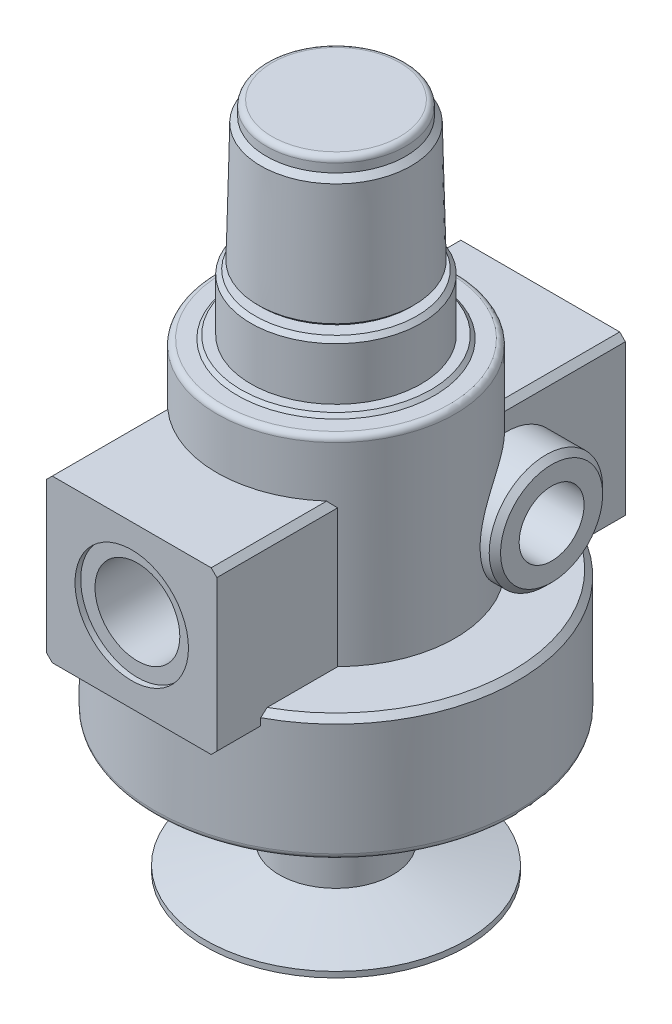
ISO-10303-21;
HEADER;
FILE_DESCRIPTION(('STEP AP214'),'2;1');
FILE_NAME('part.step','',(''),(''),'','','');
FILE_SCHEMA(('AUTOMOTIVE_DESIGN { 1 0 10303 214 1 1 1 1 }'));
ENDSEC;
DATA;
#1=APPLICATION_CONTEXT('core data for automotive mechanical design processes');
#2=APPLICATION_PROTOCOL_DEFINITION('international standard','automotive_design',2000,#1);
#3=PRODUCT_CONTEXT('',#1,'mechanical');
#4=PRODUCT('Part','Part','',(#3));
#5=PRODUCT_RELATED_PRODUCT_CATEGORY('part','',(#4));
#6=PRODUCT_DEFINITION_FORMATION('','',#4);
#7=PRODUCT_DEFINITION_CONTEXT('part definition',#1,'design');
#8=PRODUCT_DEFINITION('design','',#6,#7);
#9=PRODUCT_DEFINITION_SHAPE('','',#8);
#10=(LENGTH_UNIT() NAMED_UNIT(*) SI_UNIT(.MILLI.,.METRE.));
#11=(NAMED_UNIT(*) PLANE_ANGLE_UNIT() SI_UNIT($,.RADIAN.));
#12=(NAMED_UNIT(*) SI_UNIT($,.STERADIAN.) SOLID_ANGLE_UNIT());
#13=UNCERTAINTY_MEASURE_WITH_UNIT(LENGTH_MEASURE(1.E-05),#10,'distance_accuracy_value','');
#14=(GEOMETRIC_REPRESENTATION_CONTEXT(3) GLOBAL_UNCERTAINTY_ASSIGNED_CONTEXT((#13)) GLOBAL_UNIT_ASSIGNED_CONTEXT((#10,
#11,#12)) REPRESENTATION_CONTEXT('',''));
#15=CARTESIAN_POINT('',(0.,0.,0.));
#16=DIRECTION('',(0.,0.,1.));
#17=DIRECTION('',(1.,0.,0.));
#18=AXIS2_PLACEMENT_3D('',#15,#16,#17);
#19=CARTESIAN_POINT('',(0.,93.5,0.));
#20=DIRECTION('',(0.,-1.,0.));
#21=DIRECTION('',(0.,0.,-1.));
#22=AXIS2_PLACEMENT_3D('',#19,#20,#21);
#23=CYLINDRICAL_SURFACE('',#22,21.);
#24=CARTESIAN_POINT('',(0.,56.,0.));
#25=DIRECTION('',(0.,-1.,0.));
#26=DIRECTION('',(0.,0.,-1.));
#27=AXIS2_PLACEMENT_3D('',#24,#25,#26);
#28=CIRCLE('',#27,21.);
#29=CARTESIAN_POINT('',(0.,56.,-21.));
#30=VERTEX_POINT('',#29);
#31=EDGE_CURVE('E432',#30,#30,#28,.T.);
#32=ORIENTED_EDGE('',*,*,#31,.T.);
#33=EDGE_LOOP('',(#32));
#34=FACE_BOUND('',#33,.T.);
#35=CARTESIAN_POINT('',(0.,40.8,-21.));
#36=CARTESIAN_POINT('',(0.422273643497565,40.8000074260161,-20.9999977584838));
#37=CARTESIAN_POINT('',(0.844597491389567,40.8096133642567,-20.987247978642));
#38=CARTESIAN_POINT('',(1.68677386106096,40.8473679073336,-20.9363987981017));
#39=CARTESIAN_POINT('',(2.10662672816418,40.8755138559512,-20.8983030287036));
#40=CARTESIAN_POINT('',(2.94245856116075,40.9484658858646,-20.7971012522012));
#41=CARTESIAN_POINT('',(3.35843084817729,40.9932966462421,-20.7339581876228));
#42=CARTESIAN_POINT('',(4.18418164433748,41.0967469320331,-20.5832173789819));
#43=CARTESIAN_POINT('',(4.59395942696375,41.1553680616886,-20.4956167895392));
#44=CARTESIAN_POINT('',(5.47941106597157,41.2944901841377,-20.2785529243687));
#45=CARTESIAN_POINT('',(5.95361228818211,41.3770307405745,-20.1443854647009));
#46=CARTESIAN_POINT('',(6.8900740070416,41.5504030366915,-19.8436092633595));
#47=CARTESIAN_POINT('',(7.35233276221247,41.6412359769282,-19.676995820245));
#48=CARTESIAN_POINT('',(8.26402713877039,41.8249565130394,-19.3118398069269));
#49=CARTESIAN_POINT('',(8.71345346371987,41.9178455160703,-19.1132747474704));
#50=CARTESIAN_POINT('',(9.59796566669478,42.0992810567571,-18.6847665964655));
#51=CARTESIAN_POINT('',(10.033053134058,42.1878280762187,-18.4548269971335));
#52=CARTESIAN_POINT('',(10.856198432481,42.3480624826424,-17.9819741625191));
#53=CARTESIAN_POINT('',(11.2453645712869,42.4205102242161,-17.7412509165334));
#54=CARTESIAN_POINT('',(12.0088827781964,42.550883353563,-17.2335969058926));
#55=CARTESIAN_POINT('',(12.3832337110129,42.6088076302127,-16.9666641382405));
#56=CARTESIAN_POINT('',(13.1146720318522,42.7044568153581,-16.4078291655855));
#57=CARTESIAN_POINT('',(13.4717856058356,42.7422133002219,-16.1159668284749));
#58=CARTESIAN_POINT('',(14.1669883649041,42.7917164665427,-15.5083619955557));
#59=CARTESIAN_POINT('',(14.5050847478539,42.8034730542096,-15.1926286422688));
#60=CARTESIAN_POINT('',(15.0686705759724,42.7959485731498,-14.6303382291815));
#61=CARTESIAN_POINT('',(15.2993786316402,42.7843732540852,-14.3888901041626));
#62=CARTESIAN_POINT('',(15.7482071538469,42.7419698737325,-13.8962193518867));
#63=CARTESIAN_POINT('',(15.9663310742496,42.7111471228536,-13.644999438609));
#64=CARTESIAN_POINT('',(16.3885917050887,42.6279122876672,-13.1348245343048));
#65=CARTESIAN_POINT('',(16.5927402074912,42.5755186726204,-12.8758763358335));
#66=CARTESIAN_POINT('',(16.985973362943,42.4469276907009,-12.3524806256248));
#67=CARTESIAN_POINT('',(17.1750602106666,42.370733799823,-12.0880339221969));
#68=CARTESIAN_POINT('',(17.5097517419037,42.2060694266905,-11.5966898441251));
#69=CARTESIAN_POINT('',(17.6576173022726,42.1211732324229,-11.3701320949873));
#70=CARTESIAN_POINT('',(17.9410482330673,41.9319608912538,-10.9174207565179));
#71=CARTESIAN_POINT('',(18.0766147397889,41.8276465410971,-10.6912671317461));
#72=CARTESIAN_POINT('',(18.3349977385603,41.5990536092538,-10.2418281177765));
#73=CARTESIAN_POINT('',(18.45781668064,41.4747788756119,-10.0185421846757));
#74=CARTESIAN_POINT('',(18.6905232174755,41.2060736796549,-9.5773972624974));
#75=CARTESIAN_POINT('',(18.8004106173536,41.0616429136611,-9.35953835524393));
#76=CARTESIAN_POINT('',(19.0076503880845,40.752326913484,-8.93118398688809));
#77=CARTESIAN_POINT('',(19.1049571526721,40.5873712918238,-8.72071722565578));
#78=CARTESIAN_POINT('',(19.2868749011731,40.2380805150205,-8.31064301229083));
#79=CARTESIAN_POINT('',(19.3714857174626,40.0537451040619,-8.11103570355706));
#80=CARTESIAN_POINT('',(19.5285544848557,39.6667449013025,-7.72521613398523));
#81=CARTESIAN_POINT('',(19.6010112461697,39.4640783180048,-7.53900518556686));
#82=CARTESIAN_POINT('',(19.7344955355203,39.0418352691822,-7.18233667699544));
#83=CARTESIAN_POINT('',(19.7955235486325,38.8222595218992,-7.01187844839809));
#84=CARTESIAN_POINT('',(19.9035242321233,38.3821314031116,-6.6989099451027));
#85=CARTESIAN_POINT('',(19.9511384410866,38.1625043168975,-6.55531726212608));
#86=CARTESIAN_POINT('',(20.0378660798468,37.7113946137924,-6.2852246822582));
#87=CARTESIAN_POINT('',(20.0769799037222,37.4799125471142,-6.1587239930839));
#88=CARTESIAN_POINT('',(20.1474775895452,37.006729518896,-5.92403311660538));
#89=CARTESIAN_POINT('',(20.1788616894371,36.765028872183,-5.81584236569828));
#90=CARTESIAN_POINT('',(20.2346262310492,36.2731018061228,-5.61875400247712));
#91=CARTESIAN_POINT('',(20.2590065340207,36.0228752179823,-5.52985677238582));
#92=CARTESIAN_POINT('',(20.3015390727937,35.5139856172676,-5.37161746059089));
#93=CARTESIAN_POINT('',(20.3196494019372,35.2552780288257,-5.30240749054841));
#94=CARTESIAN_POINT('',(20.3499472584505,34.7328159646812,-5.18491378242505));
#95=CARTESIAN_POINT('',(20.3621347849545,34.469061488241,-5.13663004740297));
#96=CARTESIAN_POINT('',(20.3809690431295,33.9383131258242,-5.06138399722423));
#97=CARTESIAN_POINT('',(20.3876153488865,33.6713189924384,-5.03442332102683));
#98=CARTESIAN_POINT('',(20.3955828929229,33.1359473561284,-5.00204723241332));
#99=CARTESIAN_POINT('',(20.3969040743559,32.867569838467,-4.99663204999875));
#100=CARTESIAN_POINT('',(20.3942449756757,32.3271090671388,-5.00747507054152));
#101=CARTESIAN_POINT('',(20.3901821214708,32.0550329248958,-5.02407085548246));
#102=CARTESIAN_POINT('',(20.3764717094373,31.5132786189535,-5.07939070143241));
#103=CARTESIAN_POINT('',(20.3668240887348,31.243600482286,-5.11811501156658));
#104=CARTESIAN_POINT('',(20.3416245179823,30.7085539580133,-5.21736814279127));
#105=CARTESIAN_POINT('',(20.3260723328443,30.4431857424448,-5.27789783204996));
#106=CARTESIAN_POINT('',(20.2885787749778,29.9186801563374,-5.42023823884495));
#107=CARTESIAN_POINT('',(20.2666374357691,29.6595427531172,-5.50204884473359));
#108=CARTESIAN_POINT('',(20.215748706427,29.1494942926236,-5.68617765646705));
#109=CARTESIAN_POINT('',(20.1868043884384,28.8985796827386,-5.78848686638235));
#110=CARTESIAN_POINT('',(20.1211666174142,28.4067008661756,-6.01267720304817));
#111=CARTESIAN_POINT('',(20.0844731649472,28.1657366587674,-6.13455832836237));
#112=CARTESIAN_POINT('',(20.0025376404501,27.6955852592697,-6.39666526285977));
#113=CARTESIAN_POINT('',(19.9572973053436,27.466395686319,-6.53688734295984));
#114=CARTESIAN_POINT('',(19.8574354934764,27.0214217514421,-6.83424021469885));
#115=CARTESIAN_POINT('',(19.8028141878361,26.8056371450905,-6.9913706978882));
#116=CARTESIAN_POINT('',(19.684377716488,26.3924229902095,-7.31812559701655));
#117=CARTESIAN_POINT('',(19.6207281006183,26.1947503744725,-7.48750272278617));
#118=CARTESIAN_POINT('',(19.4829181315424,25.8151242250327,-7.83910327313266));
#119=CARTESIAN_POINT('',(19.4087579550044,25.6331704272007,-8.02132648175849));
#120=CARTESIAN_POINT('',(19.249408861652,25.2860434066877,-8.39653386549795));
#121=CARTESIAN_POINT('',(19.1642220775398,25.1208669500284,-8.589515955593));
#122=CARTESIAN_POINT('',(18.9824507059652,24.8079958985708,-8.98408229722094));
#123=CARTESIAN_POINT('',(18.8858661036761,24.660301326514,-9.1856665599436));
#124=CARTESIAN_POINT('',(18.6816194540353,24.383461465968,-9.59421709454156));
#125=CARTESIAN_POINT('',(18.5740111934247,24.2542328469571,-9.80115386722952));
#126=CARTESIAN_POINT('',(18.3473940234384,24.0135917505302,-10.2190818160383));
#127=CARTESIAN_POINT('',(18.2283852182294,23.9021791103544,-10.4300729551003));
#128=CARTESIAN_POINT('',(17.9791800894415,23.6969097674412,-10.8540106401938));
#129=CARTESIAN_POINT('',(17.8489820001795,23.6030558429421,-11.0669574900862));
#130=CARTESIAN_POINT('',(17.5778059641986,23.4323864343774,-11.4928008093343));
#131=CARTESIAN_POINT('',(17.4368275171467,23.355571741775,-11.705697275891));
#132=CARTESIAN_POINT('',(17.1336279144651,23.2130428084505,-12.1455916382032));
#133=CARTESIAN_POINT('',(16.9706065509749,23.1485955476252,-12.3724477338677));
#134=CARTESIAN_POINT('',(16.6334491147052,23.0372846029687,-12.8221438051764));
#135=CARTESIAN_POINT('',(16.4593127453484,22.9904213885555,-13.0449836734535));
#136=CARTESIAN_POINT('',(16.1006809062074,22.9128815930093,-13.4851277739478));
#137=CARTESIAN_POINT('',(15.9161831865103,22.8822085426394,-13.7024307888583));
#138=CARTESIAN_POINT('',(15.5376451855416,22.8355728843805,-14.1302241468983));
#139=CARTESIAN_POINT('',(15.3436027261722,22.819613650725,-14.3407129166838));
#140=CARTESIAN_POINT('',(14.8301963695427,22.7953929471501,-14.8752071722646));
#141=CARTESIAN_POINT('',(14.5041473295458,22.7971536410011,-15.1932962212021));
#142=CARTESIAN_POINT('',(13.8327466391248,22.8278785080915,-15.8070334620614));
#143=CARTESIAN_POINT('',(13.4873857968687,22.8568557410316,-16.102670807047));
#144=CARTESIAN_POINT('',(12.7787855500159,22.9363553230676,-16.6706147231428));
#145=CARTESIAN_POINT('',(12.4154976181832,22.9869393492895,-16.9428518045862));
#146=CARTESIAN_POINT('',(11.6739247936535,23.1041774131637,-17.4620857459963));
#147=CARTESIAN_POINT('',(11.2956403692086,23.1708309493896,-17.7090833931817));
#148=CARTESIAN_POINT('',(10.4008503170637,23.3383901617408,-18.2531684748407));
#149=CARTESIAN_POINT('',(9.87922689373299,23.4434002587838,-18.540602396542));
#150=CARTESIAN_POINT('',(8.81467751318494,23.6611226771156,-19.0697411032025));
#151=CARTESIAN_POINT('',(8.27174325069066,23.7738380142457,-19.3114278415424));
#152=CARTESIAN_POINT('',(7.16729017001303,23.995643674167,-19.747966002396));
#153=CARTESIAN_POINT('',(6.60579121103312,24.1047376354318,-19.9428657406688));
#154=CARTESIAN_POINT('',(5.46592405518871,24.3082711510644,-20.2849068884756));
#155=CARTESIAN_POINT('',(4.88756205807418,24.4027160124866,-20.4320656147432));
#156=CARTESIAN_POINT('',(3.82602331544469,24.5511365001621,-20.6542561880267));
#157=CARTESIAN_POINT('',(3.34518381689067,24.6093734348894,-20.7376172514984));
#158=CARTESIAN_POINT('',(2.37676302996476,24.7042842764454,-20.8707872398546));
#159=CARTESIAN_POINT('',(1.88918277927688,24.7409614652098,-20.9206012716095));
#160=CARTESIAN_POINT('',(0.91137131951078,24.7893576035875,-20.9859244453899));
#161=CARTESIAN_POINT('',(0.421146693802,24.8011226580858,-21.0014969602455));
#162=CARTESIAN_POINT('',(-0.559135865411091,24.7987073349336,-20.9982763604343));
#163=CARTESIAN_POINT('',(-1.0491937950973,24.7845263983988,-20.9794825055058));
#164=CARTESIAN_POINT('',(-2.02422169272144,24.7316380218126,-20.9079155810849));
#165=CARTESIAN_POINT('',(-2.50920123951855,24.6929912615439,-20.8552265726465));
#166=CARTESIAN_POINT('',(-3.47220691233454,24.5947077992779,-20.7166720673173));
#167=CARTESIAN_POINT('',(-3.95023258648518,24.5350697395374,-20.6308044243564));
#168=CARTESIAN_POINT('',(-4.89821279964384,24.399538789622,-20.4265337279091));
#169=CARTESIAN_POINT('',(-5.36814277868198,24.3236035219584,-20.3080456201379));
#170=CARTESIAN_POINT('',(-6.29705485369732,24.1612386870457,-20.0394842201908));
#171=CARTESIAN_POINT('',(-6.75603527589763,24.0748075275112,-19.8894061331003));
#172=CARTESIAN_POINT('',(-7.70864811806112,23.8882031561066,-19.5412345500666));
#173=CARTESIAN_POINT('',(-8.20095624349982,23.7875331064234,-19.3397808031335));
#174=CARTESIAN_POINT('',(-9.16937621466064,23.5886359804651,-18.8998785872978));
#175=CARTESIAN_POINT('',(-9.64548538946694,23.49040930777,-18.661424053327));
#176=CARTESIAN_POINT('',(-10.579133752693,23.3046446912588,-18.1484221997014));
#177=CARTESIAN_POINT('',(-11.0366991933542,23.2170912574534,-17.8739284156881));
#178=CARTESIAN_POINT('',(-11.9317637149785,23.060861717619,-17.289258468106));
#179=CARTESIAN_POINT('',(-12.3692707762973,22.9921780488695,-16.9790966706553));
#180=CARTESIAN_POINT('',(-13.0966082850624,22.8985812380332,-16.4202101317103));
#181=CARTESIAN_POINT('',(-13.3921743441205,22.8667406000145,-16.1800827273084));
#182=CARTESIAN_POINT('',(-13.9706090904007,22.8202577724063,-15.6833458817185));
#183=CARTESIAN_POINT('',(-14.2534783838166,22.8056147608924,-15.4267372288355));
#184=CARTESIAN_POINT('',(-14.8046748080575,22.7970308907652,-14.8985613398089));
#185=CARTESIAN_POINT('',(-15.0730181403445,22.8030664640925,-14.6270114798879));
#186=CARTESIAN_POINT('',(-15.5937545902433,22.839388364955,-14.0705328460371));
#187=CARTESIAN_POINT('',(-15.8461509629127,22.8696697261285,-13.7856068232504));
#188=CARTESIAN_POINT('',(-16.286105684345,22.9495020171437,-13.2610823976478));
#189=CARTESIAN_POINT('',(-16.4767749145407,22.9942046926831,-13.0233516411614));
#190=CARTESIAN_POINT('',(-16.8455259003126,23.103479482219,-12.5427248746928));
#191=CARTESIAN_POINT('',(-17.0236089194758,23.1680495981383,-12.2998293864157));
#192=CARTESIAN_POINT('',(-17.3661938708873,23.3186053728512,-11.8111943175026));
#193=CARTESIAN_POINT('',(-17.530700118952,23.404584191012,-11.5654556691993));
#194=CARTESIAN_POINT('',(-17.8453804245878,23.5992205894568,-11.073734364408));
#195=CARTESIAN_POINT('',(-17.9955543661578,23.707878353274,-10.8277517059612));
#196=CARTESIAN_POINT('',(-18.2819984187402,23.9495677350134,-10.3368217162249));
#197=CARTESIAN_POINT('',(-18.4181597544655,24.0827704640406,-10.0918948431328));
#198=CARTESIAN_POINT('',(-18.6750057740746,24.3733181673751,-9.60828462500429));
#199=CARTESIAN_POINT('',(-18.7956901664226,24.5306635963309,-9.36960139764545));
#200=CARTESIAN_POINT('',(-19.0215849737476,24.8691471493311,-8.90206248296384));
#201=CARTESIAN_POINT('',(-19.1267990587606,25.0502796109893,-8.67320447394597));
#202=CARTESIAN_POINT('',(-19.3221819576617,25.4354541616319,-8.22874389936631));
#203=CARTESIAN_POINT('',(-19.412352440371,25.639493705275,-8.01313986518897));
#204=CARTESIAN_POINT('',(-19.5684716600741,26.0433448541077,-7.62322972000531));
#205=CARTESIAN_POINT('',(-19.6360270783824,26.2407506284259,-7.44706677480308));
#206=CARTESIAN_POINT('',(-19.7607326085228,26.6508992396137,-7.10955804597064));
#207=CARTESIAN_POINT('',(-19.8178836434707,26.8636407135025,-6.94821094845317));
#208=CARTESIAN_POINT('',(-19.9225602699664,27.3029525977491,-6.64212081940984));
#209=CARTESIAN_POINT('',(-19.9700865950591,27.5295219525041,-6.49737652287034));
#210=CARTESIAN_POINT('',(-20.0563514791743,27.9948536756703,-6.22599783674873));
#211=CARTESIAN_POINT('',(-20.095089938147,28.2336161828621,-6.09936365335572));
#212=CARTESIAN_POINT('',(-20.1637520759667,28.7156089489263,-5.86832819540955));
#213=CARTESIAN_POINT('',(-20.1938675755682,28.958588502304,-5.7634602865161));
#214=CARTESIAN_POINT('',(-20.24722433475,29.4527525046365,-5.57312143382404));
#215=CARTESIAN_POINT('',(-20.2704657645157,29.703936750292,-5.48765000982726));
#216=CARTESIAN_POINT('',(-20.3106927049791,30.2127715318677,-5.33683969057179));
#217=CARTESIAN_POINT('',(-20.327678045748,30.4704222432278,-5.27150134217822));
#218=CARTESIAN_POINT('',(-20.3558864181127,30.9904128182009,-5.1615031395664));
#219=CARTESIAN_POINT('',(-20.3671093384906,31.2527527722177,-5.11684368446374));
#220=CARTESIAN_POINT('',(-20.3842924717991,31.7850132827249,-5.04796084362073));
#221=CARTESIAN_POINT('',(-20.3901558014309,32.0549857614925,-5.02411401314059));
#222=CARTESIAN_POINT('',(-20.3964714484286,32.5960396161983,-4.99841249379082));
#223=CARTESIAN_POINT('',(-20.3969237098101,32.8671210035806,-4.99655803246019));
#224=CARTESIAN_POINT('',(-20.3924322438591,33.4085200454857,-5.01485749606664));
#225=CARTESIAN_POINT('',(-20.3874880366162,33.6788376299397,-5.03501337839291));
#226=CARTESIAN_POINT('',(-20.3720364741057,34.2167897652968,-5.09717106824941));
#227=CARTESIAN_POINT('',(-20.3615291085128,34.4844243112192,-5.13917291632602));
#228=CARTESIAN_POINT('',(-20.3345087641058,35.0171240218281,-5.24507003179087));
#229=CARTESIAN_POINT('',(-20.3179511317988,35.2821546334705,-5.30912787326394));
#230=CARTESIAN_POINT('',(-20.2783300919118,35.8056604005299,-5.4585065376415));
#231=CARTESIAN_POINT('',(-20.2552666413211,36.0641355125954,-5.54382750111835));
#232=CARTESIAN_POINT('',(-20.2019841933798,36.5726167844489,-5.73495146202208));
#233=CARTESIAN_POINT('',(-20.1717657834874,36.8226236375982,-5.840752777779));
#234=CARTESIAN_POINT('',(-20.1034150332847,37.3123405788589,-6.07183762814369));
#235=CARTESIAN_POINT('',(-20.065282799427,37.5520508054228,-6.19712090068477));
#236=CARTESIAN_POINT('',(-19.980704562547,38.0170868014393,-6.46458903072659));
#237=CARTESIAN_POINT('',(-19.9343445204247,38.2425313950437,-6.60659446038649));
#238=CARTESIAN_POINT('',(-19.8322540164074,38.6799651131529,-6.90701500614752));
#239=CARTESIAN_POINT('',(-19.7765236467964,38.8919543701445,-7.06542996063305));
#240=CARTESIAN_POINT('',(-19.6549426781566,39.3009531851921,-7.39691644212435));
#241=CARTESIAN_POINT('',(-19.5890947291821,39.4979666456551,-7.56998412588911));
#242=CARTESIAN_POINT('',(-19.4466006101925,39.8758047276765,-7.92887032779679));
#243=CARTESIAN_POINT('',(-19.3699545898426,40.0566295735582,-8.1146886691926));
#244=CARTESIAN_POINT('',(-19.2067280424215,40.398186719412,-8.49372996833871));
#245=CARTESIAN_POINT('',(-19.1203359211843,40.5592053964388,-8.68677622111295));
#246=CARTESIAN_POINT('',(-18.9362947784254,40.8639423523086,-9.08097152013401));
#247=CARTESIAN_POINT('',(-18.8386459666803,41.0076609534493,-9.28212041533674));
#248=CARTESIAN_POINT('',(-18.6319710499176,41.2774390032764,-9.69030326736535));
#249=CARTESIAN_POINT('',(-18.5229452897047,41.403498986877,-9.89733704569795));
#250=CARTESIAN_POINT('',(-18.2935874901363,41.6379389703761,-10.3151074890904));
#251=CARTESIAN_POINT('',(-18.1732551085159,41.7463184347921,-10.5258442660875));
#252=CARTESIAN_POINT('',(-17.9178187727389,41.9486287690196,-10.9551808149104));
#253=CARTESIAN_POINT('',(-17.7823832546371,42.0420376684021,-11.1738288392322));
#254=CARTESIAN_POINT('',(-17.5002554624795,42.2110366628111,-11.610714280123));
#255=CARTESIAN_POINT('',(-17.3535632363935,42.2866268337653,-11.8289516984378));
#256=CARTESIAN_POINT('',(-17.0494470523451,42.4209004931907,-12.2632230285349));
#257=CARTESIAN_POINT('',(-16.8920197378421,42.4795786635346,-12.479256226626));
#258=CARTESIAN_POINT('',(-16.5671165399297,42.5810936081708,-12.9074765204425));
#259=CARTESIAN_POINT('',(-16.3996385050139,42.6239269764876,-13.1196627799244));
#260=CARTESIAN_POINT('',(-15.9767562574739,42.7111639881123,-13.6344820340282));
#261=CARTESIAN_POINT('',(-15.7160956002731,42.7473694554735,-13.934216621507));
#262=CARTESIAN_POINT('',(-15.1770639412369,42.792764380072,-14.5194772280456));
#263=CARTESIAN_POINT('',(-14.8986863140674,42.8019436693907,-14.8049978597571));
#264=CARTESIAN_POINT('',(-14.3257587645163,42.7973750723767,-15.360078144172));
#265=CARTESIAN_POINT('',(-14.0311813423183,42.7835869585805,-15.629608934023));
#266=CARTESIAN_POINT('',(-13.4280846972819,42.7370170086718,-16.1507105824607));
#267=CARTESIAN_POINT('',(-13.1195652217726,42.7042348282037,-16.4022811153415));
#268=CARTESIAN_POINT('',(-12.3598749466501,42.6068032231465,-16.9867142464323));
#269=CARTESIAN_POINT('',(-11.90244381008,42.5345829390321,-17.3102056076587));
#270=CARTESIAN_POINT('',(-10.9658080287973,42.3699088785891,-17.9182354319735));
#271=CARTESIAN_POINT('',(-10.4865942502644,42.2774465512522,-18.2027573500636));
#272=CARTESIAN_POINT('',(-9.50780614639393,42.0815564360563,-18.73264510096));
#273=CARTESIAN_POINT('',(-9.00818992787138,41.9781053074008,-18.977924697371));
#274=CARTESIAN_POINT('',(-7.99140475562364,41.7696413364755,-19.4279834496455));
#275=CARTESIAN_POINT('',(-7.47423679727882,41.6646285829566,-19.6327648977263));
#276=CARTESIAN_POINT('',(-6.39601750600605,41.4568052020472,-20.0108590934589));
#277=CARTESIAN_POINT('',(-5.83409447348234,41.3544079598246,-20.1819220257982));
#278=CARTESIAN_POINT('',(-4.69469761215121,41.1686022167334,-20.4769581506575));
#279=CARTESIAN_POINT('',(-4.11722342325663,41.0851941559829,-20.6009302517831));
#280=CARTESIAN_POINT('',(-3.24351049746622,40.9816823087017,-20.7500984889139));
#281=CARTESIAN_POINT('',(-2.95157084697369,40.9508157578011,-20.7936426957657));
#282=CARTESIAN_POINT('',(-2.36540185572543,40.8971268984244,-20.8684480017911));
#283=CARTESIAN_POINT('',(-2.07117285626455,40.8743034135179,-20.899710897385));
#284=CARTESIAN_POINT('',(-1.48118645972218,40.8374725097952,-20.9497902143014));
#285=CARTESIAN_POINT('',(-1.18542951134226,40.8234626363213,-20.9686101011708));
#286=CARTESIAN_POINT('',(-0.593123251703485,40.8047241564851,-20.9937152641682));
#287=CARTESIAN_POINT('',(-0.296574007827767,40.7999947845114,-21.0000015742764));
#288=CARTESIAN_POINT('',(0.,40.8,-21.));
#289=B_SPLINE_CURVE_WITH_KNOTS('',3,(#35,#36,#37,#38,#39,#40,#41,#42,#43,#44,#45,#46,#47,#48,
#49,#50,#51,#52,#53,#54,#55,#56,#57,#58,#59,#60,#61,#62,#63,#64,#65,#66,#67,#68,#69,#70,#71,#72,
#73,#74,#75,#76,#77,#78,#79,#80,#81,#82,#83,#84,#85,#86,#87,#88,#89,#90,#91,#92,#93,#94,#95,#96,
#97,#98,#99,#100,#101,#102,#103,#104,#105,#106,#107,#108,#109,#110,#111,#112,#113,#114,#115,
#116,#117,#118,#119,#120,#121,#122,#123,#124,#125,#126,#127,#128,#129,#130,#131,#132,#133,#134,
#135,#136,#137,#138,#139,#140,#141,#142,#143,#144,#145,#146,#147,#148,#149,#150,#151,#152,#153,
#154,#155,#156,#157,#158,#159,#160,#161,#162,#163,#164,#165,#166,#167,#168,#169,#170,#171,#172,
#173,#174,#175,#176,#177,#178,#179,#180,#181,#182,#183,#184,#185,#186,#187,#188,#189,#190,#191,
#192,#193,#194,#195,#196,#197,#198,#199,#200,#201,#202,#203,#204,#205,#206,#207,#208,#209,#210,
#211,#212,#213,#214,#215,#216,#217,#218,#219,#220,#221,#222,#223,#224,#225,#226,#227,#228,#229,
#230,#231,#232,#233,#234,#235,#236,#237,#238,#239,#240,#241,#242,#243,#244,#245,#246,#247,#248,
#249,#250,#251,#252,#253,#254,#255,#256,#257,#258,#259,#260,#261,#262,#263,#264,#265,#266,#267,
#268,#269,#270,#271,#272,#273,#274,#275,#276,#277,#278,#279,#280,#281,#282,#283,#284,#285,#286,
#287,#288),.UNSPECIFIED.,.T.,.F.,(4,2,2,2,2,2,2,2,2,2,2,2,2,2,2,2,2,2,2,2,2,2,2,2,2,2,2,2,2,2,2,
2,2,2,2,2,2,2,2,2,2,2,2,2,2,2,2,2,2,2,2,2,2,2,2,2,2,2,2,2,2,2,2,2,2,2,2,2,2,2,2,2,2,2,2,2,2,2,2,
2,2,2,2,2,2,2,2,2,2,2,2,2,2,2,2,2,2,2,2,2,2,2,2,2,2,2,2,2,2,2,2,2,2,2,2,2,2,2,2,2,2,2,2,2,2,2,
4),(0.,1.26661200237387,2.53304257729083,3.80135386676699,5.0698127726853,6.56747895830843,
8.06536231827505,9.56430461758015,11.0630802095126,12.4518806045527,13.8407872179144,
15.2275128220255,16.6137099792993,17.6153431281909,18.6167000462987,19.6172013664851,
20.6175566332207,21.467334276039,22.3170333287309,23.1665687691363,24.0161170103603,
24.8686634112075,25.7212210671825,26.5738621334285,27.4264670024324,28.2255885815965,
29.0246731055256,29.8237330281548,30.6228087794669,31.4271266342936,32.2314446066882,
33.035824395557,33.8402127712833,34.657081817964,35.4739600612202,36.2908708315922,
37.1077773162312,37.924326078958,38.7408747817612,39.5572577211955,40.3736257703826,
41.1765994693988,41.979559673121,42.7823648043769,43.5851709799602,44.3842314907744,
45.1832847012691,45.9824642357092,46.7816808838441,47.6409222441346,48.5001865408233,
49.3596381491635,50.2192868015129,51.5836961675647,52.9487605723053,54.317747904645,
55.6866925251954,57.4985992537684,59.3112192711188,61.1219593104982,62.9320418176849,
64.4049563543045,65.877646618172,67.3476089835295,68.8176030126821,70.2839653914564,
71.7504226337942,73.2207403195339,74.6912813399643,76.313878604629,77.9367421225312,
79.5572216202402,81.1770507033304,82.3226562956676,83.4682071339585,84.6124527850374,
85.7564641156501,86.6796340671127,87.6027112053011,88.5254937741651,89.4482838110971,
90.377768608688,91.3072709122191,92.2365523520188,93.1657306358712,93.9839277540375,
94.8020522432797,95.6201143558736,96.4381857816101,97.2363194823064,98.0344334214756,
98.8325690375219,99.6307200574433,100.443028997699,101.255346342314,102.067735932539,
102.880127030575,103.698639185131,104.517156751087,105.335607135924,106.154046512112,
106.964390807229,107.774727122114,108.584851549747,109.394964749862,110.191476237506,
110.987972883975,111.78444539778,112.580942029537,113.400989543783,114.221033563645,
115.041335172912,115.861813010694,117.056595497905,118.251827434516,119.449155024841,
120.646504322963,122.338687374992,124.031586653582,125.728156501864,127.424630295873,
129.211232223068,130.997875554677,131.887902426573,132.777799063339,133.667447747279,
134.557023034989),.UNSPECIFIED.);
#290=CARTESIAN_POINT('',(15.,42.7954066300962,-14.6969384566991));
#291=VERTEX_POINT('',#290);
#292=CARTESIAN_POINT('',(15.,22.8045933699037,-14.6969384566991));
#293=VERTEX_POINT('',#292);
#294=EDGE_CURVE('E212',#291,#293,#289,.T.);
#295=ORIENTED_EDGE('',*,*,#294,.F.);
#296=DIRECTION('',(0.,-1.,0.));
#297=VECTOR('',#296,1.);
#298=CARTESIAN_POINT('',(15.,93.5,-14.6969384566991));
#299=LINE('',#298,#297);
#300=CARTESIAN_POINT('',(15.,46.05,-14.6969384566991));
#301=VERTEX_POINT('',#300);
#302=EDGE_CURVE('E490',#301,#291,#299,.T.);
#303=ORIENTED_EDGE('',*,*,#302,.F.);
#304=CARTESIAN_POINT('',(0.,61.05,0.));
#305=DIRECTION('',(-0.707106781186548,-0.707106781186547,0.));
#306=DIRECTION('',(0.707106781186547,-0.707106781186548,0.));
#307=AXIS2_PLACEMENT_3D('',#304,#305,#306);
#308=ELLIPSE('',#307,29.698484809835,21.);
#309=CARTESIAN_POINT('',(14.,47.05,-15.6524758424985));
#310=VERTEX_POINT('',#309);
#311=EDGE_CURVE('E485',#310,#301,#308,.T.);
#312=ORIENTED_EDGE('',*,*,#311,.F.);
#313=CARTESIAN_POINT('',(0.,47.05,0.));
#314=DIRECTION('',(0.,-1.,0.));
#315=DIRECTION('',(0.,0.,-1.));
#316=AXIS2_PLACEMENT_3D('',#313,#314,#315);
#317=CIRCLE('',#316,21.);
#318=CARTESIAN_POINT('',(-14.,47.05,-15.6524758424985));
#319=VERTEX_POINT('',#318);
#320=EDGE_CURVE('E482',#319,#310,#317,.T.);
#321=ORIENTED_EDGE('',*,*,#320,.F.);
#322=CARTESIAN_POINT('',(0.,61.05,0.));
#323=DIRECTION('',(0.707106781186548,-0.707106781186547,0.));
#324=DIRECTION('',(-0.707106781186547,-0.707106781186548,0.));
#325=AXIS2_PLACEMENT_3D('',#322,#323,#324);
#326=ELLIPSE('',#325,29.698484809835,21.);
#327=CARTESIAN_POINT('',(-15.,46.05,-14.6969384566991));
#328=VERTEX_POINT('',#327);
#329=EDGE_CURVE('E492',#328,#319,#326,.T.);
#330=ORIENTED_EDGE('',*,*,#329,.F.);
#331=DIRECTION('',(0.,-1.,0.));
#332=VECTOR('',#331,1.);
#333=CARTESIAN_POINT('',(-15.,93.5,-14.6969384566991));
#334=LINE('',#333,#332);
#335=CARTESIAN_POINT('',(-15.,42.7954066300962,-14.6969384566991));
#336=VERTEX_POINT('',#335);
#337=EDGE_CURVE('E203',#336,#328,#334,.F.);
#338=ORIENTED_EDGE('',*,*,#337,.F.);
#339=CARTESIAN_POINT('',(-15.,22.8045933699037,-14.6969384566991));
#340=VERTEX_POINT('',#339);
#341=EDGE_CURVE('E206',#340,#336,#289,.T.);
#342=ORIENTED_EDGE('',*,*,#341,.F.);
#343=CARTESIAN_POINT('',(-15.,21.8,-14.6969384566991));
#344=VERTEX_POINT('',#343);
#345=EDGE_CURVE('E194',#344,#340,#334,.F.);
#346=ORIENTED_EDGE('',*,*,#345,.F.);
#347=CARTESIAN_POINT('',(0.,21.8,0.));
#348=DIRECTION('',(0.,-1.,0.));
#349=DIRECTION('',(0.,0.,-1.));
#350=AXIS2_PLACEMENT_3D('',#347,#348,#349);
#351=CIRCLE('',#350,21.);
#352=CARTESIAN_POINT('',(-15.,21.8,14.6969384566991));
#353=VERTEX_POINT('',#352);
#354=EDGE_CURVE('E434',#353,#344,#351,.T.);
#355=ORIENTED_EDGE('',*,*,#354,.F.);
#356=DIRECTION('',(0.,-1.,0.));
#357=VECTOR('',#356,1.);
#358=CARTESIAN_POINT('',(-15.,93.5,14.6969384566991));
#359=LINE('',#358,#357);
#360=CARTESIAN_POINT('',(-15.,46.05,14.6969384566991));
#361=VERTEX_POINT('',#360);
#362=EDGE_CURVE('E499',#361,#353,#359,.T.);
#363=ORIENTED_EDGE('',*,*,#362,.F.);
#364=CARTESIAN_POINT('',(-14.,47.05,15.6524758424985));
#365=VERTEX_POINT('',#364);
#366=EDGE_CURVE('E494',#365,#361,#326,.T.);
#367=ORIENTED_EDGE('',*,*,#366,.F.);
#368=CARTESIAN_POINT('',(14.,47.05,15.6524758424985));
#369=VERTEX_POINT('',#368);
#370=EDGE_CURVE('E202',#369,#365,#317,.T.);
#371=ORIENTED_EDGE('',*,*,#370,.F.);
#372=CARTESIAN_POINT('',(15.,46.05,14.6969384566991));
#373=VERTEX_POINT('',#372);
#374=EDGE_CURVE('E489',#373,#369,#308,.T.);
#375=ORIENTED_EDGE('',*,*,#374,.F.);
#376=DIRECTION('',(0.,-1.,0.));
#377=VECTOR('',#376,1.);
#378=CARTESIAN_POINT('',(15.,93.5,14.6969384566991));
#379=LINE('',#378,#377);
#380=CARTESIAN_POINT('',(15.,21.8,14.6969384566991));
#381=VERTEX_POINT('',#380);
#382=EDGE_CURVE('E496',#381,#373,#379,.F.);
#383=ORIENTED_EDGE('',*,*,#382,.F.);
#384=CARTESIAN_POINT('',(15.,21.8,-14.6969384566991));
#385=VERTEX_POINT('',#384);
#386=EDGE_CURVE('E435',#385,#381,#351,.T.);
#387=ORIENTED_EDGE('',*,*,#386,.F.);
#388=EDGE_CURVE('E488',#293,#385,#299,.T.);
#389=ORIENTED_EDGE('',*,*,#388,.F.);
#390=EDGE_LOOP('',(#295,#303,#312,#321,#330,#338,#342,#346,#355,#363,#367,#371,#375,#383,#387,#389));
#391=FACE_BOUND('',#390,.T.);
#392=ADVANCED_FACE('F37',(#34,#391),#23,.T.);
#393=CARTESIAN_POINT('',(0.,93.5,0.));
#394=DIRECTION('',(0.,-1.,0.));
#395=DIRECTION('',(0.,0.,-1.));
#396=AXIS2_PLACEMENT_3D('',#393,#394,#395);
#397=CYLINDRICAL_SURFACE('',#396,32.);
#398=CARTESIAN_POINT('',(0.,1.,0.));
#399=DIRECTION('',(0.,-1.,0.));
#400=DIRECTION('',(0.,0.,-1.));
#401=AXIS2_PLACEMENT_3D('',#398,#399,#400);
#402=CIRCLE('',#401,32.);
#403=CARTESIAN_POINT('',(0.,1.,-32.));
#404=VERTEX_POINT('',#403);
#405=EDGE_CURVE('E446',#404,#404,#402,.T.);
#406=ORIENTED_EDGE('',*,*,#405,.F.);
#407=EDGE_LOOP('',(#406));
#408=FACE_BOUND('',#407,.T.);
#409=DIRECTION('',(0.,-1.,0.));
#410=VECTOR('',#409,1.);
#411=CARTESIAN_POINT('',(-15.,93.5,-28.2665880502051));
#412=LINE('',#411,#410);
#413=CARTESIAN_POINT('',(-15.,19.55,-28.2665880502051));
#414=VERTEX_POINT('',#413);
#415=CARTESIAN_POINT('',(-15.,20.8,-28.2665880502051));
#416=VERTEX_POINT('',#415);
#417=EDGE_CURVE('E382',#414,#416,#412,.F.);
#418=ORIENTED_EDGE('',*,*,#417,.F.);
#419=CARTESIAN_POINT('',(0.,4.54999999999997,0.));
#420=DIRECTION('',(0.707106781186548,0.707106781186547,0.));
#421=DIRECTION('',(0.707106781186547,-0.707106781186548,0.));
#422=AXIS2_PLACEMENT_3D('',#419,#420,#421);
#423=ELLIPSE('',#422,45.2548339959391,32.);
#424=CARTESIAN_POINT('',(-14.,18.55,-28.7749891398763));
#425=VERTEX_POINT('',#424);
#426=EDGE_CURVE('E45',#425,#414,#423,.T.);
#427=ORIENTED_EDGE('',*,*,#426,.F.);
#428=CARTESIAN_POINT('',(0.,18.55,0.));
#429=DIRECTION('',(0.,1.,0.));
#430=DIRECTION('',(0.,0.,1.));
#431=AXIS2_PLACEMENT_3D('',#428,#429,#430);
#432=CIRCLE('',#431,32.);
#433=CARTESIAN_POINT('',(14.,18.55,-28.7749891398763));
#434=VERTEX_POINT('',#433);
#435=EDGE_CURVE('E509',#434,#425,#432,.T.);
#436=ORIENTED_EDGE('',*,*,#435,.F.);
#437=CARTESIAN_POINT('',(0.,4.54999999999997,0.));
#438=DIRECTION('',(-0.707106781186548,0.707106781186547,0.));
#439=DIRECTION('',(-0.707106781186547,-0.707106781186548,0.));
#440=AXIS2_PLACEMENT_3D('',#437,#438,#439);
#441=ELLIPSE('',#440,45.2548339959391,32.);
#442=CARTESIAN_POINT('',(15.,19.55,-28.2665880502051));
#443=VERTEX_POINT('',#442);
#444=EDGE_CURVE('E506',#443,#434,#441,.T.);
#445=ORIENTED_EDGE('',*,*,#444,.F.);
#446=DIRECTION('',(0.,-1.,0.));
#447=VECTOR('',#446,1.);
#448=CARTESIAN_POINT('',(15.,93.5,-28.2665880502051));
#449=LINE('',#448,#447);
#450=CARTESIAN_POINT('',(15.,20.8,-28.2665880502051));
#451=VERTEX_POINT('',#450);
#452=EDGE_CURVE('E542',#451,#443,#449,.T.);
#453=ORIENTED_EDGE('',*,*,#452,.F.);
#454=CARTESIAN_POINT('',(0.,20.8,0.));
#455=DIRECTION('',(0.,-1.,0.));
#456=DIRECTION('',(0.,0.,-1.));
#457=AXIS2_PLACEMENT_3D('',#454,#455,#456);
#458=CIRCLE('',#457,32.);
#459=CARTESIAN_POINT('',(15.,20.8,28.2665880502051));
#460=VERTEX_POINT('',#459);
#461=EDGE_CURVE('E443',#451,#460,#458,.T.);
#462=ORIENTED_EDGE('',*,*,#461,.T.);
#463=DIRECTION('',(0.,-1.,0.));
#464=VECTOR('',#463,1.);
#465=CARTESIAN_POINT('',(15.,93.5,28.2665880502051));
#466=LINE('',#465,#464);
#467=CARTESIAN_POINT('',(15.,19.55,28.2665880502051));
#468=VERTEX_POINT('',#467);
#469=EDGE_CURVE('E339',#468,#460,#466,.F.);
#470=ORIENTED_EDGE('',*,*,#469,.F.);
#471=CARTESIAN_POINT('',(14.,18.55,28.7749891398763));
#472=VERTEX_POINT('',#471);
#473=EDGE_CURVE('E502',#472,#468,#441,.T.);
#474=ORIENTED_EDGE('',*,*,#473,.F.);
#475=CARTESIAN_POINT('',(-14.,18.55,28.7749891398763));
#476=VERTEX_POINT('',#475);
#477=EDGE_CURVE('E505',#476,#472,#432,.T.);
#478=ORIENTED_EDGE('',*,*,#477,.F.);
#479=CARTESIAN_POINT('',(-15.,19.55,28.2665880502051));
#480=VERTEX_POINT('',#479);
#481=EDGE_CURVE('E508',#480,#476,#423,.T.);
#482=ORIENTED_EDGE('',*,*,#481,.F.);
#483=DIRECTION('',(0.,-1.,0.));
#484=VECTOR('',#483,1.);
#485=CARTESIAN_POINT('',(-15.,93.5,28.2665880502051));
#486=LINE('',#485,#484);
#487=CARTESIAN_POINT('',(-15.,20.8,28.2665880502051));
#488=VERTEX_POINT('',#487);
#489=EDGE_CURVE('E387',#488,#480,#486,.T.);
#490=ORIENTED_EDGE('',*,*,#489,.F.);
#491=EDGE_CURVE('E442',#488,#416,#458,.T.);
#492=ORIENTED_EDGE('',*,*,#491,.T.);
#493=EDGE_LOOP('',(#418,#427,#436,#445,#453,#462,#470,#474,#478,#482,#490,#492));
#494=FACE_BOUND('',#493,.T.);
#495=ADVANCED_FACE('F232',(#408,#494),#397,.T.);
#496=CARTESIAN_POINT('',(0.,21.8,0.));
#497=DIRECTION('',(0.,-1.,0.));
#498=DIRECTION('',(0.,0.,-1.));
#499=AXIS2_PLACEMENT_3D('',#496,#497,#498);
#500=CONICAL_SURFACE('',#499,31.,0.785398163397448);
#501=CARTESIAN_POINT('',(-15.,-17.6048872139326,-68.7884303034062));
#502=CARTESIAN_POINT('',(-15.,-16.6092774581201,-67.769414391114));
#503=CARTESIAN_POINT('',(-15.,-15.614171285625,-66.7499060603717));
#504=CARTESIAN_POINT('',(-15.,-13.6251356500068,-64.7097405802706));
#505=CARTESIAN_POINT('',(-15.,-12.6312061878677,-63.6890834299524));
#506=CARTESIAN_POINT('',(-15.,-10.6445802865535,-61.6463398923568));
#507=CARTESIAN_POINT('',(-15.,-9.65188400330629,-60.6242533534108));
#508=CARTESIAN_POINT('',(-15.,-7.66805569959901,-58.5785636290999));
#509=CARTESIAN_POINT('',(-15.,-6.67692367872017,-57.5549604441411));
#510=CARTESIAN_POINT('',(-15.,-4.69253510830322,-55.5019026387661));
#511=CARTESIAN_POINT('',(-15.,-3.69928585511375,-54.4724409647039));
#512=CARTESIAN_POINT('',(-15.,-1.7149558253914,-52.4114299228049));
#513=CARTESIAN_POINT('',(-15.,-0.72387504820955,-51.3798805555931));
#514=CARTESIAN_POINT('',(-15.,1.25560657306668,-49.3144144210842));
#515=CARTESIAN_POINT('',(-15.,2.24400767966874,-48.2804979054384));
#516=CARTESIAN_POINT('',(-15.,4.21770827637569,-46.209709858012));
#517=CARTESIAN_POINT('',(-15.,5.20300777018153,-45.1728383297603));
#518=CARTESIAN_POINT('',(-15.,7.20515993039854,-43.0582092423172));
#519=CARTESIAN_POINT('',(-15.,8.22187459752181,-41.9803209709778));
#520=CARTESIAN_POINT('',(-15.,10.2502795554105,-39.8198105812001));
#521=CARTESIAN_POINT('',(-15.,11.2619698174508,-38.7371884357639));
#522=CARTESIAN_POINT('',(-15.,12.7748824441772,-37.1086274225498));
#523=CARTESIAN_POINT('',(-15.,13.2784989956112,-36.5649122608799));
#524=CARTESIAN_POINT('',(-15.,14.2839131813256,-35.4758061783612));
#525=CARTESIAN_POINT('',(-15.,14.7857108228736,-34.930415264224));
#526=CARTESIAN_POINT('',(-15.,15.7872254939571,-33.8377480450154));
#527=CARTESIAN_POINT('',(-15.,16.286942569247,-33.2904717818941));
#528=CARTESIAN_POINT('',(-15.,17.2840104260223,-32.1937523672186));
#529=CARTESIAN_POINT('',(-15.,17.7813611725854,-31.6443091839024));
#530=CARTESIAN_POINT('',(-15.,18.7723307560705,-30.5440551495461));
#531=CARTESIAN_POINT('',(-15.,19.265955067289,-29.9932492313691));
#532=CARTESIAN_POINT('',(-15.,20.2500305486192,-28.8888104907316));
#533=CARTESIAN_POINT('',(-15.,20.7404817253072,-28.3351776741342));
#534=CARTESIAN_POINT('',(-15.,21.7176580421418,-27.224650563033));
#535=CARTESIAN_POINT('',(-15.,22.2043832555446,-26.6677563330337));
#536=CARTESIAN_POINT('',(-15.,23.1734382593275,-25.5501599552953));
#537=CARTESIAN_POINT('',(-15.,23.6557680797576,-24.9894578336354));
#538=CARTESIAN_POINT('',(-15.,24.6149416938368,-23.8638687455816));
#539=CARTESIAN_POINT('',(-15.,25.0917881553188,-23.2989840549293));
#540=CARTESIAN_POINT('',(-15.,26.0391719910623,-22.1639272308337));
#541=CARTESIAN_POINT('',(-15.,26.5097092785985,-21.5937550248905));
#542=CARTESIAN_POINT('',(-15.,27.4429952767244,-20.4472145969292));
#543=CARTESIAN_POINT('',(-15.,27.9057452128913,-19.8708473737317));
#544=CARTESIAN_POINT('',(-15.,28.8216960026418,-18.710586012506));
#545=CARTESIAN_POINT('',(-15.,29.2748972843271,-18.1266922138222));
#546=CARTESIAN_POINT('',(-15.,29.8352979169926,-17.3892743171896));
#547=CARTESIAN_POINT('',(-15.,29.948120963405,-17.2400144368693));
#548=CARTESIAN_POINT('',(-15.,30.1729461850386,-16.9408769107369));
#549=CARTESIAN_POINT('',(-15.,30.2849483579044,-16.7909992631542));
#550=CARTESIAN_POINT('',(-15.,30.6196533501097,-16.3403870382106));
#551=CARTESIAN_POINT('',(-15.,30.8410496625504,-16.0386797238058));
#552=CARTESIAN_POINT('',(-15.,31.2799111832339,-15.4323680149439));
#553=CARTESIAN_POINT('',(-15.,31.4973759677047,-15.1277633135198));
#554=CARTESIAN_POINT('',(-15.,31.9277963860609,-14.5153823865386));
#555=CARTESIAN_POINT('',(-15.,32.1407520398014,-14.2076061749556));
#556=CARTESIAN_POINT('',(-15.,32.5618909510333,-13.5879656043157));
#557=CARTESIAN_POINT('',(-15.,32.7700646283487,-13.2760947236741));
#558=CARTESIAN_POINT('',(-15.,33.1804440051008,-12.648452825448));
#559=CARTESIAN_POINT('',(-15.,33.3826498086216,-12.33268187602));
#560=CARTESIAN_POINT('',(-15.,33.7801637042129,-11.6968271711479));
#561=CARTESIAN_POINT('',(-15.,33.9754720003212,-11.3767435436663));
#562=CARTESIAN_POINT('',(-15.,34.3580677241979,-10.7318308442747));
#563=CARTESIAN_POINT('',(-15.,34.5453553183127,-10.4070018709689));
#564=CARTESIAN_POINT('',(-15.,35.0343671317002,-9.53026497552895));
#565=CARTESIAN_POINT('',(-15.,35.327668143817,-8.97359100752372));
#566=CARTESIAN_POINT('',(-15.,35.8803129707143,-7.84339335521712));
#567=CARTESIAN_POINT('',(-15.,36.1396517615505,-7.26986719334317));
#568=CARTESIAN_POINT('',(-15.,36.6131424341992,-6.10693880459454));
#569=CARTESIAN_POINT('',(-15.,36.8274860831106,-5.51761654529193));
#570=CARTESIAN_POINT('',(-15.,37.106992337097,-4.6207291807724));
#571=CARTESIAN_POINT('',(-15.,37.193150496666,-4.31965879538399));
#572=CARTESIAN_POINT('',(-15.,37.3499355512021,-3.71351643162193));
#573=CARTESIAN_POINT('',(-15.,37.4205642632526,-3.40844492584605));
#574=CARTESIAN_POINT('',(-15.,37.5722313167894,-2.6593717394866));
#575=CARTESIAN_POINT('',(-15.,37.6441098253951,-2.21346893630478));
#576=CARTESIAN_POINT('',(-15.,37.7488592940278,-1.31707135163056));
#577=CARTESIAN_POINT('',(-15.,37.7817372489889,-0.866577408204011));
#578=CARTESIAN_POINT('',(-15.,37.8004874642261,-0.190450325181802));
#579=CARTESIAN_POINT('',(-15.,37.801652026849,0.0348464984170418));
#580=CARTESIAN_POINT('',(-15.,37.7938396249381,0.485270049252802));
#581=CARTESIAN_POINT('',(-15.,37.7848630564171,0.710396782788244));
#582=CARTESIAN_POINT('',(-15.,37.756884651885,1.16003921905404));
#583=CARTESIAN_POINT('',(-15.,37.7378820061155,1.38455487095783));
#584=CARTESIAN_POINT('',(-15.,37.6901126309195,1.83257236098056));
#585=CARTESIAN_POINT('',(-15.,37.6613444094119,2.05607403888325));
#586=CARTESIAN_POINT('',(-15.,37.5861403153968,2.55674882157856));
#587=CARTESIAN_POINT('',(-15.,37.5370950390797,2.83353304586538));
#588=CARTESIAN_POINT('',(-15.,37.4253146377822,3.38433964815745));
#589=CARTESIAN_POINT('',(-15.,37.3625767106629,3.65836144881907));
#590=CARTESIAN_POINT('',(-15.,37.1553391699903,4.47584126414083));
#591=CARTESIAN_POINT('',(-15.,36.9918367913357,5.0145799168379));
#592=CARTESIAN_POINT('',(-15.,36.7149270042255,5.81313925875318));
#593=CARTESIAN_POINT('',(-15.,36.6169913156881,6.07854913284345));
#594=CARTESIAN_POINT('',(-15.,36.411738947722,6.60559893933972));
#595=CARTESIAN_POINT('',(-15.,36.304426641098,6.86724056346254));
#596=CARTESIAN_POINT('',(-15.,36.081419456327,7.38688232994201));
#597=CARTESIAN_POINT('',(-15.,35.9657252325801,7.64488275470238));
#598=CARTESIAN_POINT('',(-15.,35.7268563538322,8.15742794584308));
#599=CARTESIAN_POINT('',(-15.,35.6036807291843,8.41197225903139));
#600=CARTESIAN_POINT('',(-15.,35.2699824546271,9.07911357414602));
#601=CARTESIAN_POINT('',(-15.,35.0538768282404,9.48892187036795));
#602=CARTESIAN_POINT('',(-15.,34.6069941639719,10.300494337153));
#603=CARTESIAN_POINT('',(-15.,34.3762145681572,10.7022570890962));
#604=CARTESIAN_POINT('',(-15.,33.9023877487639,11.4987952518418));
#605=CARTESIAN_POINT('',(-15.,33.6593330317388,11.8935661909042));
#606=CARTESIAN_POINT('',(-15.,33.1631418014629,12.6766690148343));
#607=CARTESIAN_POINT('',(-15.,32.9100058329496,13.0650012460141));
#608=CARTESIAN_POINT('',(-15.,32.3946096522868,13.8370063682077));
#609=CARTESIAN_POINT('',(-15.,32.1323274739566,14.220664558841));
#610=CARTESIAN_POINT('',(-15.,31.600591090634,14.9829740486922));
#611=CARTESIAN_POINT('',(-15.,31.3311368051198,15.3616252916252));
#612=CARTESIAN_POINT('',(-15.,30.786230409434,16.1143870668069));
#613=CARTESIAN_POINT('',(-15.,30.5107803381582,16.4884990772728));
#614=CARTESIAN_POINT('',(-15.,29.9546645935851,17.2328303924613));
#615=CARTESIAN_POINT('',(-15.,29.6739988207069,17.6030496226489));
#616=CARTESIAN_POINT('',(-15.,28.8200910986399,18.7153380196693));
#617=CARTESIAN_POINT('',(-15.,28.2399763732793,19.4521339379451));
#618=CARTESIAN_POINT('',(-15.,27.0660400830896,20.9147433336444));
#619=CARTESIAN_POINT('',(-15.,26.4722176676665,21.6405561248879));
#620=CARTESIAN_POINT('',(-15.,25.2749844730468,23.0821879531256));
#621=CARTESIAN_POINT('',(-15.,24.671591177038,23.7980215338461));
#622=CARTESIAN_POINT('',(-15.,23.4565145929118,25.2225723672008));
#623=CARTESIAN_POINT('',(-15.,22.8448315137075,25.9312897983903));
#624=CARTESIAN_POINT('',(-15.,21.4168459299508,27.5701346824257));
#625=CARTESIAN_POINT('',(-15.,20.5980595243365,28.4980960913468));
#626=CARTESIAN_POINT('',(-15.,18.9516290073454,30.3461359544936));
#627=CARTESIAN_POINT('',(-15.,18.123984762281,31.266214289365));
#628=CARTESIAN_POINT('',(-15.,16.4617295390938,33.1001493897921));
#629=CARTESIAN_POINT('',(-15.,15.627118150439,34.0140057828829));
#630=CARTESIAN_POINT('',(-15.,13.9523958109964,35.8366513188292));
#631=CARTESIAN_POINT('',(-15.,13.1122848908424,36.7454404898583));
#632=CARTESIAN_POINT('',(-15.,11.4268590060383,38.5596881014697));
#633=CARTESIAN_POINT('',(-15.,10.5815400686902,39.4651428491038));
#634=CARTESIAN_POINT('',(-15.,8.88724232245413,41.2726218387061));
#635=CARTESIAN_POINT('',(-15.,8.03826350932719,42.1746460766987));
#636=CARTESIAN_POINT('',(-15.,6.33729649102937,43.9757947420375));
#637=CARTESIAN_POINT('',(-15.,5.48530838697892,44.8749192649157));
#638=CARTESIAN_POINT('',(-15.,3.7787786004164,46.6707422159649));
#639=CARTESIAN_POINT('',(-15.,2.92423691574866,47.5674406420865));
#640=CARTESIAN_POINT('',(-15.,0.439333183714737,50.1686622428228));
#641=CARTESIAN_POINT('',(-15.,-1.1938565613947,51.8704842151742));
#642=CARTESIAN_POINT('',(-15.,-4.46606700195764,55.2685403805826));
#643=CARTESIAN_POINT('',(-15.,-6.10508775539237,56.9647745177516));
#644=CARTESIAN_POINT('',(-15.,-9.3856059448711,60.3508514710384));
#645=CARTESIAN_POINT('',(-15.,-11.0270979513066,62.0406995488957));
#646=CARTESIAN_POINT('',(-15.,-13.4919493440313,64.5729026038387));
#647=CARTESIAN_POINT('',(-15.,-14.3139961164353,65.4165360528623));
#648=CARTESIAN_POINT('',(-15.,-15.9588749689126,67.1030364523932));
#649=CARTESIAN_POINT('',(-15.,-16.7817070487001,67.9459034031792));
#650=CARTESIAN_POINT('',(-15.,-17.6048872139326,68.7884303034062));
#651=B_SPLINE_CURVE_WITH_KNOTS('',3,(#501,#502,#503,#504,#505,#506,#507,#508,#509,#510,#511,
#512,#513,#514,#515,#516,#517,#518,#519,#520,#521,#522,#523,#524,#525,#526,#527,#528,#529,#530,
#531,#532,#533,#534,#535,#536,#537,#538,#539,#540,#541,#542,#543,#544,#545,#546,#547,#548,#549,
#550,#551,#552,#553,#554,#555,#556,#557,#558,#559,#560,#561,#562,#563,#564,#565,#566,#567,#568,
#569,#570,#571,#572,#573,#574,#575,#576,#577,#578,#579,#580,#581,#582,#583,#584,#585,#586,#587,
#588,#589,#590,#591,#592,#593,#594,#595,#596,#597,#598,#599,#600,#601,#602,#603,#604,#605,#606,
#607,#608,#609,#610,#611,#612,#613,#614,#615,#616,#617,#618,#619,#620,#621,#622,#623,#624,#625,
#626,#627,#628,#629,#630,#631,#632,#633,#634,#635,#636,#637,#638,#639,#640,#641,#642,#643,#644,
#645,#646,#647,#648,#649,#650),.UNSPECIFIED.,.F.,.F.,(4,2,2,2,2,2,2,2,2,2,2,2,2,2,2,2,2,2,2,2,2,
2,2,2,2,2,2,2,2,2,2,2,2,2,2,2,2,2,2,2,2,2,2,2,2,2,2,2,2,2,2,2,2,2,2,2,2,2,2,2,2,2,2,2,2,2,2,2,2,
2,2,2,2,2,4),(0.,4.27395508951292,8.54791375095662,12.8223667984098,17.0968187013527,
21.3883214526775,25.6798229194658,29.9708875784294,34.2619471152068,38.7071535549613,
43.1523853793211,45.3757359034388,47.5990775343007,49.8223700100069,52.0456951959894,
54.2645738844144,56.4834479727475,58.7022783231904,60.9210934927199,63.1387791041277,
65.3564951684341,67.5738588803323,69.7911229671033,70.3524300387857,70.9137387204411,
72.0363807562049,73.1591430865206,74.2819004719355,75.4067394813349,76.5315588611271,
77.6563449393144,78.7811076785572,80.6677990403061,82.5547691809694,84.4335261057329,
85.372643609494,86.311651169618,87.6650240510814,89.018154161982,89.6938613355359,
90.3695421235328,91.0452774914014,91.7211161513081,92.5640072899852,93.4070710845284,
95.0936032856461,95.9421936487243,96.7903903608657,97.6385209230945,98.4867616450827,
99.8762592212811,101.26599967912,102.656599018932,104.047123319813,105.441254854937,
106.835402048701,108.229082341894,109.622789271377,112.435834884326,115.249055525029,
118.057623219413,120.866120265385,124.578683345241,128.291302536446,132.004142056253,
135.716960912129,139.433090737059,143.149224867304,146.865235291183,150.581248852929,
157.657353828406,164.733529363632,171.801106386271,175.334844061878,178.868580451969),.UNSPECIFIED.);
#652=CARTESIAN_POINT('',(-15.,21.8,-27.1293199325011));
#653=VERTEX_POINT('',#652);
#654=EDGE_CURVE('E376',#416,#653,#651,.T.);
#655=ORIENTED_EDGE('',*,*,#654,.F.);
#656=ORIENTED_EDGE('',*,*,#491,.F.);
#657=CARTESIAN_POINT('',(-15.,21.8,27.1293199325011));
#658=VERTEX_POINT('',#657);
#659=EDGE_CURVE('E383',#658,#488,#651,.T.);
#660=ORIENTED_EDGE('',*,*,#659,.F.);
#661=CARTESIAN_POINT('',(0.,21.8,0.));
#662=DIRECTION('',(0.,-1.,0.));
#663=DIRECTION('',(0.,0.,-1.));
#664=AXIS2_PLACEMENT_3D('',#661,#662,#663);
#665=CIRCLE('',#664,31.);
#666=EDGE_CURVE('E438',#658,#653,#665,.T.);
#667=ORIENTED_EDGE('',*,*,#666,.T.);
#668=EDGE_LOOP('',(#655,#656,#660,#667));
#669=FACE_BOUND('',#668,.T.);
#670=ADVANCED_FACE('F238',(#669),#500,.T.);
#671=CARTESIAN_POINT('',(15.,-17.6048872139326,68.7884303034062));
#672=CARTESIAN_POINT('',(15.,-16.6092774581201,67.769414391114));
#673=CARTESIAN_POINT('',(15.,-15.614171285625,66.7499060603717));
#674=CARTESIAN_POINT('',(15.,-13.6251356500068,64.7097405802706));
#675=CARTESIAN_POINT('',(15.,-12.6312061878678,63.6890834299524));
#676=CARTESIAN_POINT('',(15.,-10.6445802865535,61.6463398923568));
#677=CARTESIAN_POINT('',(15.,-9.65188400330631,60.6242533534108));
#678=CARTESIAN_POINT('',(15.,-7.66805569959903,58.5785636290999));
#679=CARTESIAN_POINT('',(15.,-6.67692367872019,57.5549604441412));
#680=CARTESIAN_POINT('',(15.,-4.69253510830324,55.5019026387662));
#681=CARTESIAN_POINT('',(15.,-3.69928585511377,54.472440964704));
#682=CARTESIAN_POINT('',(15.,-1.71495582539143,52.4114299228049));
#683=CARTESIAN_POINT('',(15.,-0.723875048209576,51.3798805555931));
#684=CARTESIAN_POINT('',(15.,1.25560657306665,49.3144144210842));
#685=CARTESIAN_POINT('',(15.,2.24400767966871,48.2804979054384));
#686=CARTESIAN_POINT('',(15.,4.21770827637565,46.209709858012));
#687=CARTESIAN_POINT('',(15.,5.20300777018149,45.1728383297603));
#688=CARTESIAN_POINT('',(15.,7.20515993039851,43.0582092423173));
#689=CARTESIAN_POINT('',(15.,8.22187459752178,41.9803209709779));
#690=CARTESIAN_POINT('',(15.,10.2502795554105,39.8198105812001));
#691=CARTESIAN_POINT('',(15.,11.2619698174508,38.737188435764));
#692=CARTESIAN_POINT('',(15.,12.7748824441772,37.1086274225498));
#693=CARTESIAN_POINT('',(15.,13.2784989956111,36.5649122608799));
#694=CARTESIAN_POINT('',(15.,14.2839131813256,35.4758061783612));
#695=CARTESIAN_POINT('',(15.,14.7857108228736,34.930415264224));
#696=CARTESIAN_POINT('',(15.,15.7872254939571,33.8377480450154));
#697=CARTESIAN_POINT('',(15.,16.2869425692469,33.2904717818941));
#698=CARTESIAN_POINT('',(15.,17.2840104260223,32.1937523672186));
#699=CARTESIAN_POINT('',(15.,17.7813611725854,31.6443091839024));
#700=CARTESIAN_POINT('',(15.,18.7723307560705,30.5440551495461));
#701=CARTESIAN_POINT('',(15.,19.265955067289,29.9932492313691));
#702=CARTESIAN_POINT('',(15.,20.2500305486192,28.8888104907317));
#703=CARTESIAN_POINT('',(15.,20.7404817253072,28.3351776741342));
#704=CARTESIAN_POINT('',(15.,21.7176580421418,27.224650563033));
#705=CARTESIAN_POINT('',(15.,22.2043832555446,26.6677563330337));
#706=CARTESIAN_POINT('',(15.,23.1734382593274,25.5501599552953));
#707=CARTESIAN_POINT('',(15.,23.6557680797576,24.9894578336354));
#708=CARTESIAN_POINT('',(15.,24.6149416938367,23.8638687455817));
#709=CARTESIAN_POINT('',(15.,25.0917881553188,23.2989840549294));
#710=CARTESIAN_POINT('',(15.,26.0391719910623,22.1639272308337));
#711=CARTESIAN_POINT('',(15.,26.5097092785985,21.5937550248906));
#712=CARTESIAN_POINT('',(15.,27.4429952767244,20.4472145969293));
#713=CARTESIAN_POINT('',(15.,27.9057452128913,19.8708473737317));
#714=CARTESIAN_POINT('',(15.,28.8216960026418,18.710586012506));
#715=CARTESIAN_POINT('',(15.,29.2748972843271,18.1266922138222));
#716=CARTESIAN_POINT('',(15.,29.8352979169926,17.3892743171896));
#717=CARTESIAN_POINT('',(15.,29.948120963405,17.2400144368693));
#718=CARTESIAN_POINT('',(15.,30.1729461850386,16.9408769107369));
#719=CARTESIAN_POINT('',(15.,30.2849483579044,16.7909992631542));
#720=CARTESIAN_POINT('',(15.,30.6196533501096,16.3403870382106));
#721=CARTESIAN_POINT('',(15.,30.8410496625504,16.0386797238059));
#722=CARTESIAN_POINT('',(15.,31.2799111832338,15.4323680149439));
#723=CARTESIAN_POINT('',(15.,31.4973759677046,15.1277633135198));
#724=CARTESIAN_POINT('',(15.,31.9277963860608,14.5153823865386));
#725=CARTESIAN_POINT('',(15.,32.1407520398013,14.2076061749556));
#726=CARTESIAN_POINT('',(15.,32.5618909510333,13.5879656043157));
#727=CARTESIAN_POINT('',(15.,32.7700646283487,13.2760947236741));
#728=CARTESIAN_POINT('',(15.,33.1804440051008,12.6484528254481));
#729=CARTESIAN_POINT('',(15.,33.3826498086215,12.33268187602));
#730=CARTESIAN_POINT('',(15.,33.7801637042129,11.6968271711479));
#731=CARTESIAN_POINT('',(15.,33.9754720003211,11.3767435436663));
#732=CARTESIAN_POINT('',(15.,34.3580677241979,10.7318308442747));
#733=CARTESIAN_POINT('',(15.,34.5453553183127,10.4070018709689));
#734=CARTESIAN_POINT('',(15.,35.0343671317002,9.53026497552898));
#735=CARTESIAN_POINT('',(15.,35.327668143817,8.97359100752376));
#736=CARTESIAN_POINT('',(15.,35.8803129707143,7.84339335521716));
#737=CARTESIAN_POINT('',(15.,36.1396517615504,7.2698671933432));
#738=CARTESIAN_POINT('',(15.,36.6131424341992,6.10693880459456));
#739=CARTESIAN_POINT('',(15.,36.8274860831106,5.51761654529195));
#740=CARTESIAN_POINT('',(15.,37.106992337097,4.62072918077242));
#741=CARTESIAN_POINT('',(15.,37.193150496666,4.31965879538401));
#742=CARTESIAN_POINT('',(15.,37.3499355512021,3.71351643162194));
#743=CARTESIAN_POINT('',(15.,37.4205642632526,3.40844492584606));
#744=CARTESIAN_POINT('',(15.,37.5722313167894,2.65937173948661));
#745=CARTESIAN_POINT('',(15.,37.6441098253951,2.21346893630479));
#746=CARTESIAN_POINT('',(15.,37.7488592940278,1.31707135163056));
#747=CARTESIAN_POINT('',(15.,37.7817372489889,0.866577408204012));
#748=CARTESIAN_POINT('',(15.,37.8004874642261,0.190450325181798));
#749=CARTESIAN_POINT('',(15.,37.801652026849,-0.0348464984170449));
#750=CARTESIAN_POINT('',(15.,37.7938396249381,-0.485270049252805));
#751=CARTESIAN_POINT('',(15.,37.7848630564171,-0.710396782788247));
#752=CARTESIAN_POINT('',(15.,37.756884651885,-1.16003921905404));
#753=CARTESIAN_POINT('',(15.,37.7378820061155,-1.38455487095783));
#754=CARTESIAN_POINT('',(15.,37.6901126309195,-1.83257236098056));
#755=CARTESIAN_POINT('',(15.,37.6613444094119,-2.05607403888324));
#756=CARTESIAN_POINT('',(15.,37.5861403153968,-2.55674882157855));
#757=CARTESIAN_POINT('',(15.,37.5370950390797,-2.83353304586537));
#758=CARTESIAN_POINT('',(15.,37.4253146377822,-3.38433964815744));
#759=CARTESIAN_POINT('',(15.,37.3625767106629,-3.65836144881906));
#760=CARTESIAN_POINT('',(15.,37.1553391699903,-4.47584126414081));
#761=CARTESIAN_POINT('',(15.,36.9918367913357,-5.01457991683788));
#762=CARTESIAN_POINT('',(15.,36.7149270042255,-5.81313925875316));
#763=CARTESIAN_POINT('',(15.,36.6169913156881,-6.07854913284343));
#764=CARTESIAN_POINT('',(15.,36.411738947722,-6.6055989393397));
#765=CARTESIAN_POINT('',(15.,36.304426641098,-6.86724056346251));
#766=CARTESIAN_POINT('',(15.,36.081419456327,-7.38688232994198));
#767=CARTESIAN_POINT('',(15.,35.9657252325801,-7.64488275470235));
#768=CARTESIAN_POINT('',(15.,35.7268563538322,-8.15742794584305));
#769=CARTESIAN_POINT('',(15.,35.6036807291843,-8.41197225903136));
#770=CARTESIAN_POINT('',(15.,35.2699824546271,-9.079113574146));
#771=CARTESIAN_POINT('',(15.,35.0538768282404,-9.48892187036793));
#772=CARTESIAN_POINT('',(15.,34.6069941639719,-10.300494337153));
#773=CARTESIAN_POINT('',(15.,34.3762145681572,-10.7022570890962));
#774=CARTESIAN_POINT('',(15.,33.9023877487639,-11.4987952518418));
#775=CARTESIAN_POINT('',(15.,33.6593330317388,-11.8935661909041));
#776=CARTESIAN_POINT('',(15.,33.163141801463,-12.6766690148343));
#777=CARTESIAN_POINT('',(15.,32.9100058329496,-13.0650012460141));
#778=CARTESIAN_POINT('',(15.,32.3946096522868,-13.8370063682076));
#779=CARTESIAN_POINT('',(15.,32.1323274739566,-14.2206645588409));
#780=CARTESIAN_POINT('',(15.,31.600591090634,-14.9829740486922));
#781=CARTESIAN_POINT('',(15.,31.3311368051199,-15.3616252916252));
#782=CARTESIAN_POINT('',(15.,30.786230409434,-16.1143870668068));
#783=CARTESIAN_POINT('',(15.,30.5107803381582,-16.4884990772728));
#784=CARTESIAN_POINT('',(15.,29.9546645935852,-17.2328303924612));
#785=CARTESIAN_POINT('',(15.,29.6739988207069,-17.6030496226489));
#786=CARTESIAN_POINT('',(15.,28.82009109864,-18.7153380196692));
#787=CARTESIAN_POINT('',(15.,28.2399763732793,-19.452133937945));
#788=CARTESIAN_POINT('',(15.,27.0660400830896,-20.9147433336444));
#789=CARTESIAN_POINT('',(15.,26.4722176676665,-21.6405561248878));
#790=CARTESIAN_POINT('',(15.,25.2749844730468,-23.0821879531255));
#791=CARTESIAN_POINT('',(15.,24.6715911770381,-23.7980215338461));
#792=CARTESIAN_POINT('',(15.,23.4565145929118,-25.2225723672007));
#793=CARTESIAN_POINT('',(15.,22.8448315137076,-25.9312897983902));
#794=CARTESIAN_POINT('',(15.,21.4168459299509,-27.5701346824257));
#795=CARTESIAN_POINT('',(15.,20.5980595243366,-28.4980960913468));
#796=CARTESIAN_POINT('',(15.,18.9516290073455,-30.3461359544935));
#797=CARTESIAN_POINT('',(15.,18.1239847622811,-31.2662142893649));
#798=CARTESIAN_POINT('',(15.,16.4617295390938,-33.100149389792));
#799=CARTESIAN_POINT('',(15.,15.6271181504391,-34.0140057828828));
#800=CARTESIAN_POINT('',(15.,13.9523958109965,-35.8366513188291));
#801=CARTESIAN_POINT('',(15.,13.1122848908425,-36.7454404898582));
#802=CARTESIAN_POINT('',(15.,11.4268590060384,-38.5596881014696));
#803=CARTESIAN_POINT('',(15.,10.5815400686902,-39.4651428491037));
#804=CARTESIAN_POINT('',(15.,8.88724232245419,-41.2726218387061));
#805=CARTESIAN_POINT('',(15.,8.03826350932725,-42.1746460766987));
#806=CARTESIAN_POINT('',(15.,6.33729649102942,-43.9757947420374));
#807=CARTESIAN_POINT('',(15.,5.48530838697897,-44.8749192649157));
#808=CARTESIAN_POINT('',(15.,3.77877860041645,-46.6707422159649));
#809=CARTESIAN_POINT('',(15.,2.9242369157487,-47.5674406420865));
#810=CARTESIAN_POINT('',(15.,0.439333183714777,-50.1686622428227));
#811=CARTESIAN_POINT('',(15.,-1.19385656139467,-51.8704842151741));
#812=CARTESIAN_POINT('',(15.,-4.46606700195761,-55.2685403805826));
#813=CARTESIAN_POINT('',(15.,-6.10508775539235,-56.9647745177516));
#814=CARTESIAN_POINT('',(15.,-9.38560594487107,-60.3508514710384));
#815=CARTESIAN_POINT('',(15.,-11.0270979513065,-62.0406995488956));
#816=CARTESIAN_POINT('',(15.,-13.4919493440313,-64.5729026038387));
#817=CARTESIAN_POINT('',(15.,-14.3139961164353,-65.4165360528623));
#818=CARTESIAN_POINT('',(15.,-15.9588749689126,-67.1030364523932));
#819=CARTESIAN_POINT('',(15.,-16.7817070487,-67.9459034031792));
#820=CARTESIAN_POINT('',(15.,-17.6048872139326,-68.7884303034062));
#821=B_SPLINE_CURVE_WITH_KNOTS('',3,(#671,#672,#673,#674,#675,#676,#677,#678,#679,#680,#681,
#682,#683,#684,#685,#686,#687,#688,#689,#690,#691,#692,#693,#694,#695,#696,#697,#698,#699,#700,
#701,#702,#703,#704,#705,#706,#707,#708,#709,#710,#711,#712,#713,#714,#715,#716,#717,#718,#719,
#720,#721,#722,#723,#724,#725,#726,#727,#728,#729,#730,#731,#732,#733,#734,#735,#736,#737,#738,
#739,#740,#741,#742,#743,#744,#745,#746,#747,#748,#749,#750,#751,#752,#753,#754,#755,#756,#757,
#758,#759,#760,#761,#762,#763,#764,#765,#766,#767,#768,#769,#770,#771,#772,#773,#774,#775,#776,
#777,#778,#779,#780,#781,#782,#783,#784,#785,#786,#787,#788,#789,#790,#791,#792,#793,#794,#795,
#796,#797,#798,#799,#800,#801,#802,#803,#804,#805,#806,#807,#808,#809,#810,#811,#812,#813,#814,
#815,#816,#817,#818,#819,#820),.UNSPECIFIED.,.F.,.F.,(4,2,2,2,2,2,2,2,2,2,2,2,2,2,2,2,2,2,2,2,2,
2,2,2,2,2,2,2,2,2,2,2,2,2,2,2,2,2,2,2,2,2,2,2,2,2,2,2,2,2,2,2,2,2,2,2,2,2,2,2,2,2,2,2,2,2,2,2,2,
2,2,2,2,2,4),(0.,4.2739550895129,8.54791375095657,12.8223667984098,17.0968187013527,
21.3883214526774,25.6798229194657,29.9708875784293,34.2619471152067,38.7071535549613,
43.152385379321,45.3757359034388,47.5990775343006,49.8223700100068,52.0456951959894,
54.2645738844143,56.4834479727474,58.7022783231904,60.9210934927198,63.1387791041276,
65.3564951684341,67.5738588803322,69.7911229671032,70.3524300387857,70.913738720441,
72.0363807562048,73.1591430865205,74.2819004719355,75.4067394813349,76.5315588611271,
77.6563449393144,78.7811076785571,80.6677990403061,82.5547691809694,84.4335261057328,
85.372643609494,86.311651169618,87.6650240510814,89.018154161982,89.6938613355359,
90.3695421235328,91.0452774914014,91.7211161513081,92.5640072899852,93.4070710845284,
95.0936032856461,95.9421936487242,96.7903903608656,97.6385209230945,98.4867616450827,
99.8762592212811,101.26599967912,102.656599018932,104.047123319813,105.441254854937,
106.835402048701,108.229082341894,109.622789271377,112.435834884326,115.249055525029,
118.057623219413,120.866120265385,124.578683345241,128.291302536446,132.004142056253,
135.716960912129,139.433090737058,143.149224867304,146.865235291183,150.581248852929,
157.657353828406,164.733529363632,171.801106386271,175.334844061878,178.868580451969),.UNSPECIFIED.);
#822=CARTESIAN_POINT('',(15.,21.8,27.1293199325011));
#823=VERTEX_POINT('',#822);
#824=EDGE_CURVE('E331',#460,#823,#821,.T.);
#825=ORIENTED_EDGE('',*,*,#824,.F.);
#826=ORIENTED_EDGE('',*,*,#461,.F.);
#827=CARTESIAN_POINT('',(15.,21.8,-27.1293199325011));
#828=VERTEX_POINT('',#827);
#829=EDGE_CURVE('E340',#828,#451,#821,.T.);
#830=ORIENTED_EDGE('',*,*,#829,.F.);
#831=EDGE_CURVE('E439',#828,#823,#665,.T.);
#832=ORIENTED_EDGE('',*,*,#831,.T.);
#833=EDGE_LOOP('',(#825,#826,#830,#832));
#834=FACE_BOUND('',#833,.T.);
#835=ADVANCED_FACE('F546',(#834),#500,.T.);
#836=CARTESIAN_POINT('',(-31.,21.8,0.));
#837=DIRECTION('',(0.,-1.,0.));
#838=DIRECTION('',(0.,0.,-1.));
#839=AXIS2_PLACEMENT_3D('',#836,#837,#838);
#840=PLANE('',#839);
#841=DIRECTION('',(0.,0.,1.));
#842=VECTOR('',#841,1.);
#843=CARTESIAN_POINT('',(-15.,21.8,0.));
#844=LINE('',#843,#842);
#845=EDGE_CURVE('E198',#653,#344,#844,.T.);
#846=ORIENTED_EDGE('',*,*,#845,.F.);
#847=ORIENTED_EDGE('',*,*,#666,.F.);
#848=EDGE_CURVE('E386',#353,#658,#844,.T.);
#849=ORIENTED_EDGE('',*,*,#848,.F.);
#850=ORIENTED_EDGE('',*,*,#354,.T.);
#851=EDGE_LOOP('',(#846,#847,#849,#850));
#852=FACE_BOUND('',#851,.T.);
#853=ADVANCED_FACE('F247',(#852),#840,.F.);
#854=DIRECTION('',(0.,0.,-1.));
#855=VECTOR('',#854,1.);
#856=CARTESIAN_POINT('',(15.,21.8,0.));
#857=LINE('',#856,#855);
#858=EDGE_CURVE('E328',#823,#381,#857,.T.);
#859=ORIENTED_EDGE('',*,*,#858,.F.);
#860=ORIENTED_EDGE('',*,*,#831,.F.);
#861=EDGE_CURVE('E332',#385,#828,#857,.T.);
#862=ORIENTED_EDGE('',*,*,#861,.F.);
#863=ORIENTED_EDGE('',*,*,#386,.T.);
#864=EDGE_LOOP('',(#859,#860,#862,#863));
#865=FACE_BOUND('',#864,.T.);
#866=ADVANCED_FACE('F581',(#865),#840,.F.);
#867=CARTESIAN_POINT('',(0.,-24.3,0.));
#868=DIRECTION('',(0.,1.,0.));
#869=DIRECTION('',(0.,0.,1.));
#870=AXIS2_PLACEMENT_3D('',#867,#868,#869);
#871=PLANE('',#870);
#872=CARTESIAN_POINT('',(0.,-24.3,0.));
#873=DIRECTION('',(0.,-1.,0.));
#874=DIRECTION('',(0.,0.,-1.));
#875=AXIS2_PLACEMENT_3D('',#872,#873,#874);
#876=CIRCLE('',#875,23.);
#877=CARTESIAN_POINT('',(0.,-24.3,-23.));
#878=VERTEX_POINT('',#877);
#879=EDGE_CURVE('E479',#878,#878,#876,.T.);
#880=ORIENTED_EDGE('',*,*,#879,.T.);
#881=EDGE_LOOP('',(#880));
#882=FACE_BOUND('',#881,.T.);
#883=ADVANCED_FACE('F39',(#882),#871,.F.);
#884=CARTESIAN_POINT('',(0.,93.5,0.));
#885=DIRECTION('',(0.,-1.,0.));
#886=DIRECTION('',(0.,0.,-1.));
#887=AXIS2_PLACEMENT_3D('',#884,#885,#886);
#888=CYLINDRICAL_SURFACE('',#887,23.);
#889=ORIENTED_EDGE('',*,*,#879,.F.);
#890=EDGE_LOOP('',(#889));
#891=FACE_BOUND('',#890,.T.);
#892=CARTESIAN_POINT('',(0.,-23.3,0.));
#893=DIRECTION('',(0.,-1.,0.));
#894=DIRECTION('',(0.,0.,-1.));
#895=AXIS2_PLACEMENT_3D('',#892,#893,#894);
#896=CIRCLE('',#895,23.);
#897=CARTESIAN_POINT('',(0.,-23.3,-23.));
#898=VERTEX_POINT('',#897);
#899=EDGE_CURVE('E476',#898,#898,#896,.T.);
#900=ORIENTED_EDGE('',*,*,#899,.T.);
#901=EDGE_LOOP('',(#900));
#902=FACE_BOUND('',#901,.T.);
#903=ADVANCED_FACE('F589',(#891,#902),#888,.T.);
#904=CARTESIAN_POINT('',(0.,-19.8166604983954,0.));
#905=DIRECTION('',(0.,-1.,0.));
#906=DIRECTION('',(0.,0.,-1.));
#907=AXIS2_PLACEMENT_3D('',#904,#905,#906);
#908=CONICAL_SURFACE('',#907,10.,1.30899693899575);
#909=ORIENTED_EDGE('',*,*,#899,.F.);
#910=EDGE_LOOP('',(#909));
#911=FACE_BOUND('',#910,.T.);
#912=CARTESIAN_POINT('',(0.,-19.8166604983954,0.));
#913=DIRECTION('',(0.,-1.,0.));
#914=DIRECTION('',(0.,0.,-1.));
#915=AXIS2_PLACEMENT_3D('',#912,#913,#914);
#916=CIRCLE('',#915,10.);
#917=CARTESIAN_POINT('',(0.,-19.8166604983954,-10.));
#918=VERTEX_POINT('',#917);
#919=EDGE_CURVE('E473',#918,#918,#916,.T.);
#920=ORIENTED_EDGE('',*,*,#919,.T.);
#921=EDGE_LOOP('',(#920));
#922=FACE_BOUND('',#921,.T.);
#923=ADVANCED_FACE('F671',(#911,#922),#908,.T.);
#924=CARTESIAN_POINT('',(0.,93.5,0.));
#925=DIRECTION('',(0.,-1.,0.));
#926=DIRECTION('',(0.,0.,-1.));
#927=AXIS2_PLACEMENT_3D('',#924,#925,#926);
#928=CYLINDRICAL_SURFACE('',#927,10.);
#929=ORIENTED_EDGE('',*,*,#919,.F.);
#930=EDGE_LOOP('',(#929));
#931=FACE_BOUND('',#930,.T.);
#932=CARTESIAN_POINT('',(0.,0.,0.));
#933=DIRECTION('',(0.,-1.,0.));
#934=DIRECTION('',(0.,0.,-1.));
#935=AXIS2_PLACEMENT_3D('',#932,#933,#934);
#936=CIRCLE('',#935,10.);
#937=CARTESIAN_POINT('',(0.,0.,-10.));
#938=VERTEX_POINT('',#937);
#939=EDGE_CURVE('E470',#938,#938,#936,.T.);
#940=ORIENTED_EDGE('',*,*,#939,.T.);
#941=EDGE_LOOP('',(#940));
#942=FACE_BOUND('',#941,.T.);
#943=ADVANCED_FACE('F676',(#931,#942),#928,.T.);
#944=CARTESIAN_POINT('',(-10.,0.,0.));
#945=DIRECTION('',(0.,1.,0.));
#946=DIRECTION('',(0.,0.,1.));
#947=AXIS2_PLACEMENT_3D('',#944,#945,#946);
#948=PLANE('',#947);
#949=ORIENTED_EDGE('',*,*,#939,.F.);
#950=EDGE_LOOP('',(#949));
#951=FACE_BOUND('',#950,.T.);
#952=CARTESIAN_POINT('',(0.,0.,0.));
#953=DIRECTION('',(0.,-1.,0.));
#954=DIRECTION('',(0.,0.,-1.));
#955=AXIS2_PLACEMENT_3D('',#952,#953,#954);
#956=CIRCLE('',#955,23.);
#957=CARTESIAN_POINT('',(0.,0.,-23.));
#958=VERTEX_POINT('',#957);
#959=EDGE_CURVE('E467',#958,#958,#956,.T.);
#960=ORIENTED_EDGE('',*,*,#959,.T.);
#961=EDGE_LOOP('',(#960));
#962=FACE_BOUND('',#961,.T.);
#963=ADVANCED_FACE('F748',(#951,#962),#948,.F.);
#964=CARTESIAN_POINT('',(0.,93.5,0.));
#965=DIRECTION('',(0.,-1.,0.));
#966=DIRECTION('',(0.,0.,-1.));
#967=AXIS2_PLACEMENT_3D('',#964,#965,#966);
#968=CYLINDRICAL_SURFACE('',#967,23.);
#969=ORIENTED_EDGE('',*,*,#959,.F.);
#970=EDGE_LOOP('',(#969));
#971=FACE_BOUND('',#970,.T.);
#972=CARTESIAN_POINT('',(0.,1.,0.));
#973=DIRECTION('',(0.,-1.,0.));
#974=DIRECTION('',(0.,0.,-1.));
#975=AXIS2_PLACEMENT_3D('',#972,#973,#974);
#976=CIRCLE('',#975,23.);
#977=CARTESIAN_POINT('',(0.,1.,-23.));
#978=VERTEX_POINT('',#977);
#979=EDGE_CURVE('E464',#978,#978,#976,.T.);
#980=ORIENTED_EDGE('',*,*,#979,.T.);
#981=EDGE_LOOP('',(#980));
#982=FACE_BOUND('',#981,.T.);
#983=ADVANCED_FACE('F735',(#971,#982),#968,.T.);
#984=CARTESIAN_POINT('',(0.,4.48333950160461,0.));
#985=DIRECTION('',(0.,-1.,0.));
#986=DIRECTION('',(0.,0.,-1.));
#987=AXIS2_PLACEMENT_3D('',#984,#985,#986);
#988=CONICAL_SURFACE('',#987,10.,1.30899693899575);
#989=ORIENTED_EDGE('',*,*,#979,.F.);
#990=EDGE_LOOP('',(#989));
#991=FACE_BOUND('',#990,.T.);
#992=CARTESIAN_POINT('',(0.,4.48333950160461,0.));
#993=DIRECTION('',(0.,-1.,0.));
#994=DIRECTION('',(0.,0.,-1.));
#995=AXIS2_PLACEMENT_3D('',#992,#993,#994);
#996=CIRCLE('',#995,10.);
#997=CARTESIAN_POINT('',(0.,4.48333950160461,-10.));
#998=VERTEX_POINT('',#997);
#999=EDGE_CURVE('E461',#998,#998,#996,.T.);
#1000=ORIENTED_EDGE('',*,*,#999,.T.);
#1001=EDGE_LOOP('',(#1000));
#1002=FACE_BOUND('',#1001,.T.);
#1003=ADVANCED_FACE('F729',(#991,#1002),#988,.T.);
#1004=CARTESIAN_POINT('',(0.,93.5,0.));
#1005=DIRECTION('',(0.,-1.,0.));
#1006=DIRECTION('',(0.,0.,-1.));
#1007=AXIS2_PLACEMENT_3D('',#1004,#1005,#1006);
#1008=CYLINDRICAL_SURFACE('',#1007,10.);
#1009=ORIENTED_EDGE('',*,*,#999,.F.);
#1010=EDGE_LOOP('',(#1009));
#1011=FACE_BOUND('',#1010,.T.);
#1012=CARTESIAN_POINT('',(0.,5.7,0.));
#1013=DIRECTION('',(0.,-1.,0.));
#1014=DIRECTION('',(0.,0.,-1.));
#1015=AXIS2_PLACEMENT_3D('',#1012,#1013,#1014);
#1016=CIRCLE('',#1015,10.);
#1017=CARTESIAN_POINT('',(0.,5.7,-10.));
#1018=VERTEX_POINT('',#1017);
#1019=EDGE_CURVE('E458',#1018,#1018,#1016,.T.);
#1020=ORIENTED_EDGE('',*,*,#1019,.T.);
#1021=EDGE_LOOP('',(#1020));
#1022=FACE_BOUND('',#1021,.T.);
#1023=ADVANCED_FACE('F734',(#1011,#1022),#1008,.T.);
#1024=CARTESIAN_POINT('',(-10.,5.7,0.));
#1025=DIRECTION('',(0.,1.,0.));
#1026=DIRECTION('',(0.,0.,1.));
#1027=AXIS2_PLACEMENT_3D('',#1024,#1025,#1026);
#1028=PLANE('',#1027);
#1029=ORIENTED_EDGE('',*,*,#1019,.F.);
#1030=EDGE_LOOP('',(#1029));
#1031=FACE_BOUND('',#1030,.T.);
#1032=CARTESIAN_POINT('',(0.,5.7,0.));
#1033=DIRECTION('',(0.,-1.,0.));
#1034=DIRECTION('',(0.,0.,-1.));
#1035=AXIS2_PLACEMENT_3D('',#1032,#1033,#1034);
#1036=CIRCLE('',#1035,30.);
#1037=CARTESIAN_POINT('',(0.,5.7,-30.));
#1038=VERTEX_POINT('',#1037);
#1039=EDGE_CURVE('E455',#1038,#1038,#1036,.T.);
#1040=ORIENTED_EDGE('',*,*,#1039,.T.);
#1041=EDGE_LOOP('',(#1040));
#1042=FACE_BOUND('',#1041,.T.);
#1043=ADVANCED_FACE('F879',(#1031,#1042),#1028,.F.);
#1044=CARTESIAN_POINT('',(0.,93.5,0.));
#1045=DIRECTION('',(0.,-1.,0.));
#1046=DIRECTION('',(0.,0.,-1.));
#1047=AXIS2_PLACEMENT_3D('',#1044,#1045,#1046);
#1048=CYLINDRICAL_SURFACE('',#1047,30.);
#1049=ORIENTED_EDGE('',*,*,#1039,.F.);
#1050=EDGE_LOOP('',(#1049));
#1051=FACE_BOUND('',#1050,.T.);
#1052=CARTESIAN_POINT('',(0.,0.,0.));
#1053=DIRECTION('',(0.,-1.,0.));
#1054=DIRECTION('',(0.,0.,-1.));
#1055=AXIS2_PLACEMENT_3D('',#1052,#1053,#1054);
#1056=CIRCLE('',#1055,30.);
#1057=CARTESIAN_POINT('',(0.,0.,-30.));
#1058=VERTEX_POINT('',#1057);
#1059=EDGE_CURVE('E452',#1058,#1058,#1056,.T.);
#1060=ORIENTED_EDGE('',*,*,#1059,.T.);
#1061=EDGE_LOOP('',(#1060));
#1062=FACE_BOUND('',#1061,.T.);
#1063=ADVANCED_FACE('F945',(#1051,#1062),#1048,.F.);
#1064=CARTESIAN_POINT('',(-30.,0.,0.));
#1065=DIRECTION('',(0.,1.,0.));
#1066=DIRECTION('',(0.,0.,1.));
#1067=AXIS2_PLACEMENT_3D('',#1064,#1065,#1066);
#1068=PLANE('',#1067);
#1069=ORIENTED_EDGE('',*,*,#1059,.F.);
#1070=EDGE_LOOP('',(#1069));
#1071=FACE_BOUND('',#1070,.T.);
#1072=CARTESIAN_POINT('',(0.,0.,0.));
#1073=DIRECTION('',(0.,-1.,0.));
#1074=DIRECTION('',(0.,0.,-1.));
#1075=AXIS2_PLACEMENT_3D('',#1072,#1073,#1074);
#1076=CIRCLE('',#1075,31.);
#1077=CARTESIAN_POINT('',(0.,0.,-31.));
#1078=VERTEX_POINT('',#1077);
#1079=EDGE_CURVE('E449',#1078,#1078,#1076,.T.);
#1080=ORIENTED_EDGE('',*,*,#1079,.T.);
#1081=EDGE_LOOP('',(#1080));
#1082=FACE_BOUND('',#1081,.T.);
#1083=ADVANCED_FACE('F868',(#1071,#1082),#1068,.F.);
#1084=CARTESIAN_POINT('',(0.,1.00000000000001,0.));
#1085=DIRECTION('',(0.,-1.,0.));
#1086=DIRECTION('',(0.,0.,-1.));
#1087=AXIS2_PLACEMENT_3D('',#1084,#1085,#1086);
#1088=TOROIDAL_SURFACE('',#1087,31.,1.00000000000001);
#1089=ORIENTED_EDGE('',*,*,#1079,.F.);
#1090=EDGE_LOOP('',(#1089));
#1091=FACE_BOUND('',#1090,.T.);
#1092=ORIENTED_EDGE('',*,*,#405,.T.);
#1093=EDGE_LOOP('',(#1092));
#1094=FACE_BOUND('',#1093,.T.);
#1095=ADVANCED_FACE('F863',(#1091,#1094),#1088,.T.);
#1096=CARTESIAN_POINT('',(0.,56.,0.));
#1097=DIRECTION('',(0.,-1.,0.));
#1098=DIRECTION('',(0.,0.,-1.));
#1099=AXIS2_PLACEMENT_3D('',#1096,#1097,#1098);
#1100=TOROIDAL_SURFACE('',#1099,20.,1.00000000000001);
#1101=ORIENTED_EDGE('',*,*,#31,.F.);
#1102=EDGE_LOOP('',(#1101));
#1103=FACE_BOUND('',#1102,.T.);
#1104=CARTESIAN_POINT('',(0.,57.,0.));
#1105=DIRECTION('',(0.,-1.,0.));
#1106=DIRECTION('',(0.,0.,-1.));
#1107=AXIS2_PLACEMENT_3D('',#1104,#1105,#1106);
#1108=CIRCLE('',#1107,20.);
#1109=CARTESIAN_POINT('',(0.,57.,-20.));
#1110=VERTEX_POINT('',#1109);
#1111=EDGE_CURVE('E429',#1110,#1110,#1108,.T.);
#1112=ORIENTED_EDGE('',*,*,#1111,.T.);
#1113=EDGE_LOOP('',(#1112));
#1114=FACE_BOUND('',#1113,.T.);
#1115=ADVANCED_FACE('F245',(#1103,#1114),#1100,.T.);
#1116=CARTESIAN_POINT('',(-20.,57.,0.));
#1117=DIRECTION('',(0.,-1.,0.));
#1118=DIRECTION('',(0.,0.,-1.));
#1119=AXIS2_PLACEMENT_3D('',#1116,#1117,#1118);
#1120=PLANE('',#1119);
#1121=ORIENTED_EDGE('',*,*,#1111,.F.);
#1122=EDGE_LOOP('',(#1121));
#1123=FACE_BOUND('',#1122,.T.);
#1124=CARTESIAN_POINT('',(0.,57.,0.));
#1125=DIRECTION('',(0.,-1.,0.));
#1126=DIRECTION('',(0.,0.,-1.));
#1127=AXIS2_PLACEMENT_3D('',#1124,#1125,#1126);
#1128=CIRCLE('',#1127,17.35);
#1129=CARTESIAN_POINT('',(0.,57.,-17.35));
#1130=VERTEX_POINT('',#1129);
#1131=EDGE_CURVE('E426',#1130,#1130,#1128,.T.);
#1132=ORIENTED_EDGE('',*,*,#1131,.T.);
#1133=EDGE_LOOP('',(#1132));
#1134=FACE_BOUND('',#1133,.T.);
#1135=ADVANCED_FACE('F798',(#1123,#1134),#1120,.F.);
#1136=CARTESIAN_POINT('',(0.,57.6,0.));
#1137=DIRECTION('',(0.,-1.,0.));
#1138=DIRECTION('',(0.,0.,-1.));
#1139=AXIS2_PLACEMENT_3D('',#1136,#1137,#1138);
#1140=CONICAL_SURFACE('',#1139,16.75,0.785398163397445);
#1141=ORIENTED_EDGE('',*,*,#1131,.F.);
#1142=EDGE_LOOP('',(#1141));
#1143=FACE_BOUND('',#1142,.T.);
#1144=CARTESIAN_POINT('',(0.,57.6,0.));
#1145=DIRECTION('',(0.,-1.,0.));
#1146=DIRECTION('',(0.,0.,-1.));
#1147=AXIS2_PLACEMENT_3D('',#1144,#1145,#1146);
#1148=CIRCLE('',#1147,16.75);
#1149=CARTESIAN_POINT('',(0.,57.6,-16.75));
#1150=VERTEX_POINT('',#1149);
#1151=EDGE_CURVE('E423',#1150,#1150,#1148,.T.);
#1152=ORIENTED_EDGE('',*,*,#1151,.T.);
#1153=EDGE_LOOP('',(#1152));
#1154=FACE_BOUND('',#1153,.T.);
#1155=ADVANCED_FACE('F792',(#1143,#1154),#1140,.T.);
#1156=CARTESIAN_POINT('',(-16.75,57.6,0.));
#1157=DIRECTION('',(0.,-1.,0.));
#1158=DIRECTION('',(0.,0.,-1.));
#1159=AXIS2_PLACEMENT_3D('',#1156,#1157,#1158);
#1160=PLANE('',#1159);
#1161=ORIENTED_EDGE('',*,*,#1151,.F.);
#1162=EDGE_LOOP('',(#1161));
#1163=FACE_BOUND('',#1162,.T.);
#1164=CARTESIAN_POINT('',(0.,57.6,0.));
#1165=DIRECTION('',(0.,-1.,0.));
#1166=DIRECTION('',(0.,0.,-1.));
#1167=AXIS2_PLACEMENT_3D('',#1164,#1165,#1166);
#1168=CIRCLE('',#1167,15.);
#1169=CARTESIAN_POINT('',(0.,57.6,-15.));
#1170=VERTEX_POINT('',#1169);
#1171=EDGE_CURVE('E420',#1170,#1170,#1168,.T.);
#1172=ORIENTED_EDGE('',*,*,#1171,.T.);
#1173=EDGE_LOOP('',(#1172));
#1174=FACE_BOUND('',#1173,.T.);
#1175=ADVANCED_FACE('F797',(#1163,#1174),#1160,.F.);
#1176=CARTESIAN_POINT('',(0.,93.5,0.));
#1177=DIRECTION('',(0.,-1.,0.));
#1178=DIRECTION('',(0.,0.,-1.));
#1179=AXIS2_PLACEMENT_3D('',#1176,#1177,#1178);
#1180=CYLINDRICAL_SURFACE('',#1179,15.);
#1181=ORIENTED_EDGE('',*,*,#1171,.F.);
#1182=EDGE_LOOP('',(#1181));
#1183=FACE_BOUND('',#1182,.T.);
#1184=CARTESIAN_POINT('',(0.,66.85,0.));
#1185=DIRECTION('',(0.,-1.,0.));
#1186=DIRECTION('',(0.,0.,-1.));
#1187=AXIS2_PLACEMENT_3D('',#1184,#1185,#1186);
#1188=CIRCLE('',#1187,15.);
#1189=CARTESIAN_POINT('',(0.,66.85,-15.));
#1190=VERTEX_POINT('',#1189);
#1191=EDGE_CURVE('E417',#1190,#1190,#1188,.T.);
#1192=ORIENTED_EDGE('',*,*,#1191,.T.);
#1193=EDGE_LOOP('',(#1192));
#1194=FACE_BOUND('',#1193,.T.);
#1195=ADVANCED_FACE('F853',(#1183,#1194),#1180,.T.);
#1196=CARTESIAN_POINT('',(0.,67.6,0.));
#1197=DIRECTION('',(0.,-1.,0.));
#1198=DIRECTION('',(0.,0.,-1.));
#1199=AXIS2_PLACEMENT_3D('',#1196,#1197,#1198);
#1200=CONICAL_SURFACE('',#1199,14.25,0.785398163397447);
#1201=ORIENTED_EDGE('',*,*,#1191,.F.);
#1202=EDGE_LOOP('',(#1201));
#1203=FACE_BOUND('',#1202,.T.);
#1204=CARTESIAN_POINT('',(0.,67.6,0.));
#1205=DIRECTION('',(0.,-1.,0.));
#1206=DIRECTION('',(0.,0.,-1.));
#1207=AXIS2_PLACEMENT_3D('',#1204,#1205,#1206);
#1208=CIRCLE('',#1207,14.25);
#1209=CARTESIAN_POINT('',(0.,67.6,-14.25));
#1210=VERTEX_POINT('',#1209);
#1211=EDGE_CURVE('E414',#1210,#1210,#1208,.T.);
#1212=ORIENTED_EDGE('',*,*,#1211,.T.);
#1213=EDGE_LOOP('',(#1212));
#1214=FACE_BOUND('',#1213,.T.);
#1215=ADVANCED_FACE('F847',(#1203,#1214),#1200,.T.);
#1216=CARTESIAN_POINT('',(-14.25,67.6,0.));
#1217=DIRECTION('',(0.,-1.,0.));
#1218=DIRECTION('',(0.,0.,-1.));
#1219=AXIS2_PLACEMENT_3D('',#1216,#1217,#1218);
#1220=PLANE('',#1219);
#1221=ORIENTED_EDGE('',*,*,#1211,.F.);
#1222=EDGE_LOOP('',(#1221));
#1223=FACE_BOUND('',#1222,.T.);
#1224=CARTESIAN_POINT('',(0.,67.6,0.));
#1225=DIRECTION('',(0.,-1.,0.));
#1226=DIRECTION('',(0.,0.,-1.));
#1227=AXIS2_PLACEMENT_3D('',#1224,#1225,#1226);
#1228=CIRCLE('',#1227,11.5);
#1229=CARTESIAN_POINT('',(0.,67.6,-11.5));
#1230=VERTEX_POINT('',#1229);
#1231=EDGE_CURVE('E411',#1230,#1230,#1228,.T.);
#1232=ORIENTED_EDGE('',*,*,#1231,.T.);
#1233=EDGE_LOOP('',(#1232));
#1234=FACE_BOUND('',#1233,.T.);
#1235=ADVANCED_FACE('F852',(#1223,#1234),#1220,.F.);
#1236=CARTESIAN_POINT('',(0.,93.5,0.));
#1237=DIRECTION('',(0.,-1.,0.));
#1238=DIRECTION('',(0.,0.,-1.));
#1239=AXIS2_PLACEMENT_3D('',#1236,#1237,#1238);
#1240=CYLINDRICAL_SURFACE('',#1239,11.5);
#1241=ORIENTED_EDGE('',*,*,#1231,.F.);
#1242=EDGE_LOOP('',(#1241));
#1243=FACE_BOUND('',#1242,.T.);
#1244=CARTESIAN_POINT('',(0.,68.5,0.));
#1245=DIRECTION('',(0.,-1.,0.));
#1246=DIRECTION('',(0.,0.,-1.));
#1247=AXIS2_PLACEMENT_3D('',#1244,#1245,#1246);
#1248=CIRCLE('',#1247,11.5);
#1249=CARTESIAN_POINT('',(0.,68.5,-11.5));
#1250=VERTEX_POINT('',#1249);
#1251=EDGE_CURVE('E408',#1250,#1250,#1248,.T.);
#1252=ORIENTED_EDGE('',*,*,#1251,.T.);
#1253=EDGE_LOOP('',(#1252));
#1254=FACE_BOUND('',#1253,.T.);
#1255=ADVANCED_FACE('F1021',(#1243,#1254),#1240,.T.);
#1256=CARTESIAN_POINT('',(-11.5,68.5,0.));
#1257=DIRECTION('',(0.,1.,0.));
#1258=DIRECTION('',(0.,0.,1.));
#1259=AXIS2_PLACEMENT_3D('',#1256,#1257,#1258);
#1260=PLANE('',#1259);
#1261=ORIENTED_EDGE('',*,*,#1251,.F.);
#1262=EDGE_LOOP('',(#1261));
#1263=FACE_BOUND('',#1262,.T.);
#1264=CARTESIAN_POINT('',(0.,68.5,0.));
#1265=DIRECTION('',(0.,-1.,0.));
#1266=DIRECTION('',(0.,0.,-1.));
#1267=AXIS2_PLACEMENT_3D('',#1264,#1265,#1266);
#1268=CIRCLE('',#1267,13.25);
#1269=CARTESIAN_POINT('',(0.,68.5,-13.25));
#1270=VERTEX_POINT('',#1269);
#1271=EDGE_CURVE('E405',#1270,#1270,#1268,.T.);
#1272=ORIENTED_EDGE('',*,*,#1271,.T.);
#1273=EDGE_LOOP('',(#1272));
#1274=FACE_BOUND('',#1273,.T.);
#1275=ADVANCED_FACE('F929',(#1263,#1274),#1260,.F.);
#1276=CARTESIAN_POINT('',(0.,68.9998648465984,0.));
#1277=DIRECTION('',(0.,1.,0.));
#1278=DIRECTION('',(0.,0.,1.));
#1279=AXIS2_PLACEMENT_3D('',#1276,#1277,#1278);
#1280=CONICAL_SURFACE('',#1279,13.7383752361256,0.773772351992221);
#1281=ORIENTED_EDGE('',*,*,#1271,.F.);
#1282=EDGE_LOOP('',(#1281));
#1283=FACE_BOUND('',#1282,.T.);
#1284=CARTESIAN_POINT('',(0.,68.9998648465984,0.));
#1285=DIRECTION('',(0.,-1.,0.));
#1286=DIRECTION('',(0.,0.,-1.));
#1287=AXIS2_PLACEMENT_3D('',#1284,#1285,#1286);
#1288=CIRCLE('',#1287,13.7383752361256);
#1289=CARTESIAN_POINT('',(0.,68.9998648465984,-13.7383752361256));
#1290=VERTEX_POINT('',#1289);
#1291=EDGE_CURVE('E402',#1290,#1290,#1288,.T.);
#1292=ORIENTED_EDGE('',*,*,#1291,.T.);
#1293=EDGE_LOOP('',(#1292));
#1294=FACE_BOUND('',#1293,.T.);
#1295=ADVANCED_FACE('F923',(#1283,#1294),#1280,.T.);
#1296=CARTESIAN_POINT('',(0.,90.,0.));
#1297=DIRECTION('',(0.,-1.,0.));
#1298=DIRECTION('',(0.,0.,-1.));
#1299=AXIS2_PLACEMENT_3D('',#1296,#1297,#1298);
#1300=CONICAL_SURFACE('',#1299,13.25,0.0232516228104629);
#1301=ORIENTED_EDGE('',*,*,#1291,.F.);
#1302=EDGE_LOOP('',(#1301));
#1303=FACE_BOUND('',#1302,.T.);
#1304=CARTESIAN_POINT('',(0.,90.,0.));
#1305=DIRECTION('',(0.,-1.,0.));
#1306=DIRECTION('',(0.,0.,-1.));
#1307=AXIS2_PLACEMENT_3D('',#1304,#1305,#1306);
#1308=CIRCLE('',#1307,13.25);
#1309=CARTESIAN_POINT('',(0.,90.,-13.25));
#1310=VERTEX_POINT('',#1309);
#1311=EDGE_CURVE('E399',#1310,#1310,#1308,.T.);
#1312=ORIENTED_EDGE('',*,*,#1311,.T.);
#1313=EDGE_LOOP('',(#1312));
#1314=FACE_BOUND('',#1313,.T.);
#1315=ADVANCED_FACE('F928',(#1303,#1314),#1300,.T.);
#1316=CARTESIAN_POINT('',(0.,90.9773,0.));
#1317=DIRECTION('',(0.,-1.,0.));
#1318=DIRECTION('',(0.,0.,-1.));
#1319=AXIS2_PLACEMENT_3D('',#1316,#1317,#1318);
#1320=CONICAL_SURFACE('',#1319,12.2727,0.785398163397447);
#1321=ORIENTED_EDGE('',*,*,#1311,.F.);
#1322=EDGE_LOOP('',(#1321));
#1323=FACE_BOUND('',#1322,.T.);
#1324=CARTESIAN_POINT('',(0.,90.9773,0.));
#1325=DIRECTION('',(0.,-1.,0.));
#1326=DIRECTION('',(0.,0.,-1.));
#1327=AXIS2_PLACEMENT_3D('',#1324,#1325,#1326);
#1328=CIRCLE('',#1327,12.2727);
#1329=CARTESIAN_POINT('',(0.,90.9773,-12.2727));
#1330=VERTEX_POINT('',#1329);
#1331=EDGE_CURVE('E396',#1330,#1330,#1328,.T.);
#1332=ORIENTED_EDGE('',*,*,#1331,.T.);
#1333=EDGE_LOOP('',(#1332));
#1334=FACE_BOUND('',#1333,.T.);
#1335=ADVANCED_FACE('F983',(#1323,#1334),#1320,.T.);
#1336=CARTESIAN_POINT('',(0.,93.5,0.));
#1337=DIRECTION('',(0.,-1.,0.));
#1338=DIRECTION('',(0.,0.,-1.));
#1339=AXIS2_PLACEMENT_3D('',#1336,#1337,#1338);
#1340=CYLINDRICAL_SURFACE('',#1339,12.2727);
#1341=ORIENTED_EDGE('',*,*,#1331,.F.);
#1342=EDGE_LOOP('',(#1341));
#1343=FACE_BOUND('',#1342,.T.);
#1344=CARTESIAN_POINT('',(0.,92.5,0.));
#1345=DIRECTION('',(0.,-1.,0.));
#1346=DIRECTION('',(0.,0.,-1.));
#1347=AXIS2_PLACEMENT_3D('',#1344,#1345,#1346);
#1348=CIRCLE('',#1347,12.2727);
#1349=CARTESIAN_POINT('',(0.,92.5,-12.2727));
#1350=VERTEX_POINT('',#1349);
#1351=EDGE_CURVE('E393',#1350,#1350,#1348,.T.);
#1352=ORIENTED_EDGE('',*,*,#1351,.T.);
#1353=EDGE_LOOP('',(#1352));
#1354=FACE_BOUND('',#1353,.T.);
#1355=ADVANCED_FACE('F973',(#1343,#1354),#1340,.T.);
#1356=CARTESIAN_POINT('',(0.,92.5,0.));
#1357=DIRECTION('',(0.,-1.,0.));
#1358=DIRECTION('',(0.,0.,-1.));
#1359=AXIS2_PLACEMENT_3D('',#1356,#1357,#1358);
#1360=TOROIDAL_SURFACE('',#1359,11.2727,0.999999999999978);
#1361=ORIENTED_EDGE('',*,*,#1351,.F.);
#1362=EDGE_LOOP('',(#1361));
#1363=FACE_BOUND('',#1362,.T.);
#1364=CARTESIAN_POINT('',(0.,93.5,0.));
#1365=DIRECTION('',(0.,-1.,0.));
#1366=DIRECTION('',(0.,0.,-1.));
#1367=AXIS2_PLACEMENT_3D('',#1364,#1365,#1366);
#1368=CIRCLE('',#1367,11.2727);
#1369=CARTESIAN_POINT('',(0.,93.5,-11.2727));
#1370=VERTEX_POINT('',#1369);
#1371=EDGE_CURVE('E390',#1370,#1370,#1368,.T.);
#1372=ORIENTED_EDGE('',*,*,#1371,.T.);
#1373=EDGE_LOOP('',(#1372));
#1374=FACE_BOUND('',#1373,.T.);
#1375=ADVANCED_FACE('F663',(#1363,#1374),#1360,.T.);
#1376=CARTESIAN_POINT('',(-11.2727,93.5,0.));
#1377=DIRECTION('',(0.,-1.,0.));
#1378=DIRECTION('',(0.,0.,-1.));
#1379=AXIS2_PLACEMENT_3D('',#1376,#1377,#1378);
#1380=PLANE('',#1379);
#1381=ORIENTED_EDGE('',*,*,#1371,.F.);
#1382=EDGE_LOOP('',(#1381));
#1383=FACE_BOUND('',#1382,.T.);
#1384=ADVANCED_FACE('F659',(#1383),#1380,.F.);
#1385=CARTESIAN_POINT('',(0.,0.,-36.));
#1386=DIRECTION('',(0.,0.,1.));
#1387=DIRECTION('',(1.,0.,0.));
#1388=AXIS2_PLACEMENT_3D('',#1385,#1386,#1387);
#1389=PLANE('',#1388);
#1390=CARTESIAN_POINT('',(0.,32.8,-36.));
#1391=DIRECTION('',(0.,0.,1.));
#1392=DIRECTION('',(1.,0.,0.));
#1393=AXIS2_PLACEMENT_3D('',#1390,#1391,#1392);
#1394=CIRCLE('',#1393,9.99720000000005);
#1395=CARTESIAN_POINT('',(9.99720000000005,32.8,-36.));
#1396=VERTEX_POINT('',#1395);
#1397=EDGE_CURVE('E1354',#1396,#1396,#1394,.T.);
#1398=ORIENTED_EDGE('',*,*,#1397,.T.);
#1399=EDGE_LOOP('',(#1398));
#1400=FACE_BOUND('',#1399,.T.);
#1401=DIRECTION('',(-0.707106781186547,-0.707106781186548,0.));
#1402=VECTOR('',#1401,1.);
#1403=CARTESIAN_POINT('',(-14.,47.05,-36.));
#1404=LINE('',#1403,#1402);
#1405=CARTESIAN_POINT('',(-14.,47.05,-36.));
#1406=VERTEX_POINT('',#1405);
#1407=CARTESIAN_POINT('',(-15.,46.05,-36.));
#1408=VERTEX_POINT('',#1407);
#1409=EDGE_CURVE('E255',#1406,#1408,#1404,.T.);
#1410=ORIENTED_EDGE('',*,*,#1409,.F.);
#1411=DIRECTION('',(-1.,0.,0.));
#1412=VECTOR('',#1411,1.);
#1413=CARTESIAN_POINT('',(14.,47.05,-36.));
#1414=LINE('',#1413,#1412);
#1415=CARTESIAN_POINT('',(14.,47.05,-36.));
#1416=VERTEX_POINT('',#1415);
#1417=EDGE_CURVE('E276',#1416,#1406,#1414,.T.);
#1418=ORIENTED_EDGE('',*,*,#1417,.F.);
#1419=DIRECTION('',(-0.707106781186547,0.707106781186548,0.));
#1420=VECTOR('',#1419,1.);
#1421=CARTESIAN_POINT('',(15.,46.05,-36.));
#1422=LINE('',#1421,#1420);
#1423=CARTESIAN_POINT('',(15.,46.05,-36.));
#1424=VERTEX_POINT('',#1423);
#1425=EDGE_CURVE('E273',#1424,#1416,#1422,.T.);
#1426=ORIENTED_EDGE('',*,*,#1425,.F.);
#1427=DIRECTION('',(0.,1.,0.));
#1428=VECTOR('',#1427,1.);
#1429=CARTESIAN_POINT('',(15.,19.55,-36.));
#1430=LINE('',#1429,#1428);
#1431=CARTESIAN_POINT('',(15.,19.55,-36.));
#1432=VERTEX_POINT('',#1431);
#1433=EDGE_CURVE('E270',#1432,#1424,#1430,.T.);
#1434=ORIENTED_EDGE('',*,*,#1433,.F.);
#1435=DIRECTION('',(0.707106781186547,0.707106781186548,0.));
#1436=VECTOR('',#1435,1.);
#1437=CARTESIAN_POINT('',(14.,18.55,-36.));
#1438=LINE('',#1437,#1436);
#1439=CARTESIAN_POINT('',(14.,18.55,-36.));
#1440=VERTEX_POINT('',#1439);
#1441=EDGE_CURVE('E267',#1440,#1432,#1438,.T.);
#1442=ORIENTED_EDGE('',*,*,#1441,.F.);
#1443=DIRECTION('',(1.,0.,0.));
#1444=VECTOR('',#1443,1.);
#1445=CARTESIAN_POINT('',(-14.,18.55,-36.));
#1446=LINE('',#1445,#1444);
#1447=CARTESIAN_POINT('',(-14.,18.55,-36.));
#1448=VERTEX_POINT('',#1447);
#1449=EDGE_CURVE('E264',#1448,#1440,#1446,.T.);
#1450=ORIENTED_EDGE('',*,*,#1449,.F.);
#1451=DIRECTION('',(0.707106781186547,-0.707106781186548,0.));
#1452=VECTOR('',#1451,1.);
#1453=CARTESIAN_POINT('',(-15.,19.55,-36.));
#1454=LINE('',#1453,#1452);
#1455=CARTESIAN_POINT('',(-15.,19.55,-36.));
#1456=VERTEX_POINT('',#1455);
#1457=EDGE_CURVE('E261',#1456,#1448,#1454,.T.);
#1458=ORIENTED_EDGE('',*,*,#1457,.F.);
#1459=DIRECTION('',(0.,-1.,0.));
#1460=VECTOR('',#1459,1.);
#1461=CARTESIAN_POINT('',(-15.,46.05,-36.));
#1462=LINE('',#1461,#1460);
#1463=EDGE_CURVE('E258',#1408,#1456,#1462,.T.);
#1464=ORIENTED_EDGE('',*,*,#1463,.F.);
#1465=EDGE_LOOP('',(#1410,#1418,#1426,#1434,#1442,#1450,#1458,#1464));
#1466=FACE_BOUND('',#1465,.T.);
#1467=ADVANCED_FACE('F526',(#1400,#1466),#1389,.F.);
#1468=CARTESIAN_POINT('',(14.,47.05,36.));
#1469=DIRECTION('',(0.,-1.,0.));
#1470=DIRECTION('',(0.,0.,-1.));
#1471=AXIS2_PLACEMENT_3D('',#1468,#1469,#1470);
#1472=PLANE('',#1471);
#1473=DIRECTION('',(0.,0.,-1.));
#1474=VECTOR('',#1473,1.);
#1475=CARTESIAN_POINT('',(-14.,47.05,36.));
#1476=LINE('',#1475,#1474);
#1477=EDGE_CURVE('E296',#319,#1406,#1476,.T.);
#1478=ORIENTED_EDGE('',*,*,#1477,.F.);
#1479=ORIENTED_EDGE('',*,*,#320,.T.);
#1480=DIRECTION('',(0.,0.,-1.));
#1481=VECTOR('',#1480,1.);
#1482=CARTESIAN_POINT('',(14.,47.05,36.));
#1483=LINE('',#1482,#1481);
#1484=EDGE_CURVE('E300',#310,#1416,#1483,.T.);
#1485=ORIENTED_EDGE('',*,*,#1484,.T.);
#1486=ORIENTED_EDGE('',*,*,#1417,.T.);
#1487=EDGE_LOOP('',(#1478,#1479,#1485,#1486));
#1488=FACE_BOUND('',#1487,.T.);
#1489=ADVANCED_FACE('F534',(#1488),#1472,.F.);
#1490=CARTESIAN_POINT('',(15.,46.05,36.));
#1491=DIRECTION('',(-0.707106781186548,-0.707106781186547,0.));
#1492=DIRECTION('',(0.707106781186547,-0.707106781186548,0.));
#1493=AXIS2_PLACEMENT_3D('',#1490,#1491,#1492);
#1494=PLANE('',#1493);
#1495=ORIENTED_EDGE('',*,*,#1484,.F.);
#1496=ORIENTED_EDGE('',*,*,#311,.T.);
#1497=DIRECTION('',(0.,0.,-1.));
#1498=VECTOR('',#1497,1.);
#1499=CARTESIAN_POINT('',(15.,46.05,36.));
#1500=LINE('',#1499,#1498);
#1501=EDGE_CURVE('E304',#301,#1424,#1500,.T.);
#1502=ORIENTED_EDGE('',*,*,#1501,.T.);
#1503=ORIENTED_EDGE('',*,*,#1425,.T.);
#1504=EDGE_LOOP('',(#1495,#1496,#1502,#1503));
#1505=FACE_BOUND('',#1504,.T.);
#1506=ADVANCED_FACE('F348',(#1505),#1494,.F.);
#1507=CARTESIAN_POINT('',(15.,19.55,36.));
#1508=DIRECTION('',(-1.,0.,0.));
#1509=DIRECTION('',(0.,0.,1.));
#1510=AXIS2_PLACEMENT_3D('',#1507,#1508,#1509);
#1511=PLANE('',#1510);
#1512=CARTESIAN_POINT('',(15.,32.8,-15.));
#1513=DIRECTION('',(-1.,0.,0.));
#1514=DIRECTION('',(0.,0.,1.));
#1515=AXIS2_PLACEMENT_3D('',#1512,#1513,#1514);
#1516=CIRCLE('',#1515,10.);
#1517=EDGE_CURVE('E52',#293,#291,#1516,.F.);
#1518=ORIENTED_EDGE('',*,*,#1517,.F.);
#1519=ORIENTED_EDGE('',*,*,#388,.T.);
#1520=ORIENTED_EDGE('',*,*,#861,.T.);
#1521=ORIENTED_EDGE('',*,*,#829,.T.);
#1522=ORIENTED_EDGE('',*,*,#452,.T.);
#1523=DIRECTION('',(0.,0.,-1.));
#1524=VECTOR('',#1523,1.);
#1525=CARTESIAN_POINT('',(15.,19.55,36.));
#1526=LINE('',#1525,#1524);
#1527=EDGE_CURVE('E308',#443,#1432,#1526,.T.);
#1528=ORIENTED_EDGE('',*,*,#1527,.T.);
#1529=ORIENTED_EDGE('',*,*,#1433,.T.);
#1530=ORIENTED_EDGE('',*,*,#1501,.F.);
#1531=ORIENTED_EDGE('',*,*,#302,.T.);
#1532=EDGE_LOOP('',(#1518,#1519,#1520,#1521,#1522,#1528,#1529,#1530,#1531));
#1533=FACE_BOUND('',#1532,.T.);
#1534=ADVANCED_FACE('F343',(#1533),#1511,.F.);
#1535=CARTESIAN_POINT('',(-15.,46.05,36.));
#1536=DIRECTION('',(1.,0.,0.));
#1537=DIRECTION('',(0.,0.,-1.));
#1538=AXIS2_PLACEMENT_3D('',#1535,#1536,#1537);
#1539=PLANE('',#1538);
#1540=CARTESIAN_POINT('',(-15.,32.8,-15.));
#1541=DIRECTION('',(1.,0.,0.));
#1542=DIRECTION('',(0.,0.,-1.));
#1543=AXIS2_PLACEMENT_3D('',#1540,#1541,#1542);
#1544=CIRCLE('',#1543,10.);
#1545=EDGE_CURVE('E11',#336,#340,#1544,.F.);
#1546=ORIENTED_EDGE('',*,*,#1545,.F.);
#1547=ORIENTED_EDGE('',*,*,#337,.T.);
#1548=DIRECTION('',(0.,0.,-1.));
#1549=VECTOR('',#1548,1.);
#1550=CARTESIAN_POINT('',(-15.,46.05,36.));
#1551=LINE('',#1550,#1549);
#1552=EDGE_CURVE('E324',#328,#1408,#1551,.T.);
#1553=ORIENTED_EDGE('',*,*,#1552,.T.);
#1554=ORIENTED_EDGE('',*,*,#1463,.T.);
#1555=DIRECTION('',(0.,0.,-1.));
#1556=VECTOR('',#1555,1.);
#1557=CARTESIAN_POINT('',(-15.,19.55,36.));
#1558=LINE('',#1557,#1556);
#1559=EDGE_CURVE('E320',#414,#1456,#1558,.T.);
#1560=ORIENTED_EDGE('',*,*,#1559,.F.);
#1561=ORIENTED_EDGE('',*,*,#417,.T.);
#1562=ORIENTED_EDGE('',*,*,#654,.T.);
#1563=ORIENTED_EDGE('',*,*,#845,.T.);
#1564=ORIENTED_EDGE('',*,*,#345,.T.);
#1565=EDGE_LOOP('',(#1546,#1547,#1553,#1554,#1560,#1561,#1562,#1563,#1564));
#1566=FACE_BOUND('',#1565,.T.);
#1567=ADVANCED_FACE('F196',(#1566),#1539,.F.);
#1568=CARTESIAN_POINT('',(-14.,47.05,36.));
#1569=DIRECTION('',(0.707106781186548,-0.707106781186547,0.));
#1570=DIRECTION('',(0.707106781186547,0.707106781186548,0.));
#1571=AXIS2_PLACEMENT_3D('',#1568,#1569,#1570);
#1572=PLANE('',#1571);
#1573=ORIENTED_EDGE('',*,*,#1552,.F.);
#1574=ORIENTED_EDGE('',*,*,#329,.T.);
#1575=ORIENTED_EDGE('',*,*,#1477,.T.);
#1576=ORIENTED_EDGE('',*,*,#1409,.T.);
#1577=EDGE_LOOP('',(#1573,#1574,#1575,#1576));
#1578=FACE_BOUND('',#1577,.T.);
#1579=ADVANCED_FACE('F355',(#1578),#1572,.F.);
#1580=CARTESIAN_POINT('',(14.,18.55,36.));
#1581=DIRECTION('',(-0.707106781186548,0.707106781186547,0.));
#1582=DIRECTION('',(-0.707106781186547,-0.707106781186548,0.));
#1583=AXIS2_PLACEMENT_3D('',#1580,#1581,#1582);
#1584=PLANE('',#1583);
#1585=ORIENTED_EDGE('',*,*,#1527,.F.);
#1586=ORIENTED_EDGE('',*,*,#444,.T.);
#1587=DIRECTION('',(0.,0.,-1.));
#1588=VECTOR('',#1587,1.);
#1589=CARTESIAN_POINT('',(14.,18.55,36.));
#1590=LINE('',#1589,#1588);
#1591=EDGE_CURVE('E312',#434,#1440,#1590,.T.);
#1592=ORIENTED_EDGE('',*,*,#1591,.T.);
#1593=ORIENTED_EDGE('',*,*,#1441,.T.);
#1594=EDGE_LOOP('',(#1585,#1586,#1592,#1593));
#1595=FACE_BOUND('',#1594,.T.);
#1596=ADVANCED_FACE('F351',(#1595),#1584,.F.);
#1597=CARTESIAN_POINT('',(-14.,18.55,36.));
#1598=DIRECTION('',(0.,1.,0.));
#1599=DIRECTION('',(0.,0.,1.));
#1600=AXIS2_PLACEMENT_3D('',#1597,#1598,#1599);
#1601=PLANE('',#1600);
#1602=ORIENTED_EDGE('',*,*,#1591,.F.);
#1603=ORIENTED_EDGE('',*,*,#435,.T.);
#1604=DIRECTION('',(0.,0.,-1.));
#1605=VECTOR('',#1604,1.);
#1606=CARTESIAN_POINT('',(-14.,18.55,36.));
#1607=LINE('',#1606,#1605);
#1608=EDGE_CURVE('E316',#425,#1448,#1607,.T.);
#1609=ORIENTED_EDGE('',*,*,#1608,.T.);
#1610=ORIENTED_EDGE('',*,*,#1449,.T.);
#1611=EDGE_LOOP('',(#1602,#1603,#1609,#1610));
#1612=FACE_BOUND('',#1611,.T.);
#1613=ADVANCED_FACE('F354',(#1612),#1601,.F.);
#1614=CARTESIAN_POINT('',(-15.,19.55,36.));
#1615=DIRECTION('',(0.707106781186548,0.707106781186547,0.));
#1616=DIRECTION('',(-0.707106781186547,0.707106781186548,0.));
#1617=AXIS2_PLACEMENT_3D('',#1614,#1615,#1616);
#1618=PLANE('',#1617);
#1619=ORIENTED_EDGE('',*,*,#1608,.F.);
#1620=ORIENTED_EDGE('',*,*,#426,.T.);
#1621=ORIENTED_EDGE('',*,*,#1559,.T.);
#1622=ORIENTED_EDGE('',*,*,#1457,.T.);
#1623=EDGE_LOOP('',(#1619,#1620,#1621,#1622));
#1624=FACE_BOUND('',#1623,.T.);
#1625=ADVANCED_FACE('F368',(#1624),#1618,.F.);
#1626=CARTESIAN_POINT('',(14.,18.55,36.));
#1627=VERTEX_POINT('',#1626);
#1628=EDGE_CURVE('E313',#1627,#472,#1590,.T.);
#1629=ORIENTED_EDGE('',*,*,#1628,.T.);
#1630=ORIENTED_EDGE('',*,*,#473,.T.);
#1631=CARTESIAN_POINT('',(15.,19.55,36.));
#1632=VERTEX_POINT('',#1631);
#1633=EDGE_CURVE('E309',#1632,#468,#1526,.T.);
#1634=ORIENTED_EDGE('',*,*,#1633,.F.);
#1635=DIRECTION('',(0.707106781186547,0.707106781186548,0.));
#1636=VECTOR('',#1635,1.);
#1637=CARTESIAN_POINT('',(14.,18.55,36.));
#1638=LINE('',#1637,#1636);
#1639=EDGE_CURVE('E288',#1627,#1632,#1638,.T.);
#1640=ORIENTED_EDGE('',*,*,#1639,.F.);
#1641=EDGE_LOOP('',(#1629,#1630,#1634,#1640));
#1642=FACE_BOUND('',#1641,.T.);
#1643=ADVANCED_FACE('F357',(#1642),#1584,.F.);
#1644=ORIENTED_EDGE('',*,*,#659,.T.);
#1645=ORIENTED_EDGE('',*,*,#489,.T.);
#1646=CARTESIAN_POINT('',(-15.,19.55,36.));
#1647=VERTEX_POINT('',#1646);
#1648=EDGE_CURVE('E321',#1647,#480,#1558,.T.);
#1649=ORIENTED_EDGE('',*,*,#1648,.F.);
#1650=DIRECTION('',(0.,-1.,0.));
#1651=VECTOR('',#1650,1.);
#1652=CARTESIAN_POINT('',(-15.,46.05,36.));
#1653=LINE('',#1652,#1651);
#1654=CARTESIAN_POINT('',(-15.,46.05,36.));
#1655=VERTEX_POINT('',#1654);
#1656=EDGE_CURVE('E282',#1655,#1647,#1653,.T.);
#1657=ORIENTED_EDGE('',*,*,#1656,.F.);
#1658=EDGE_CURVE('E325',#1655,#361,#1551,.T.);
#1659=ORIENTED_EDGE('',*,*,#1658,.T.);
#1660=ORIENTED_EDGE('',*,*,#362,.T.);
#1661=ORIENTED_EDGE('',*,*,#848,.T.);
#1662=EDGE_LOOP('',(#1644,#1645,#1649,#1657,#1659,#1660,#1661));
#1663=FACE_BOUND('',#1662,.T.);
#1664=ADVANCED_FACE('F369',(#1663),#1539,.F.);
#1665=ORIENTED_EDGE('',*,*,#1633,.T.);
#1666=ORIENTED_EDGE('',*,*,#469,.T.);
#1667=ORIENTED_EDGE('',*,*,#824,.T.);
#1668=ORIENTED_EDGE('',*,*,#858,.T.);
#1669=ORIENTED_EDGE('',*,*,#382,.T.);
#1670=CARTESIAN_POINT('',(15.,46.05,36.));
#1671=VERTEX_POINT('',#1670);
#1672=EDGE_CURVE('E305',#1671,#373,#1500,.T.);
#1673=ORIENTED_EDGE('',*,*,#1672,.F.);
#1674=DIRECTION('',(0.,1.,0.));
#1675=VECTOR('',#1674,1.);
#1676=CARTESIAN_POINT('',(15.,19.55,36.));
#1677=LINE('',#1676,#1675);
#1678=EDGE_CURVE('E290',#1632,#1671,#1677,.T.);
#1679=ORIENTED_EDGE('',*,*,#1678,.F.);
#1680=EDGE_LOOP('',(#1665,#1666,#1667,#1668,#1669,#1673,#1679));
#1681=FACE_BOUND('',#1680,.T.);
#1682=ADVANCED_FACE('F349',(#1681),#1511,.F.);
#1683=ORIENTED_EDGE('',*,*,#1672,.T.);
#1684=ORIENTED_EDGE('',*,*,#374,.T.);
#1685=CARTESIAN_POINT('',(14.,47.05,36.));
#1686=VERTEX_POINT('',#1685);
#1687=EDGE_CURVE('E301',#1686,#369,#1483,.T.);
#1688=ORIENTED_EDGE('',*,*,#1687,.F.);
#1689=DIRECTION('',(-0.707106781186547,0.707106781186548,0.));
#1690=VECTOR('',#1689,1.);
#1691=CARTESIAN_POINT('',(15.,46.05,36.));
#1692=LINE('',#1691,#1690);
#1693=EDGE_CURVE('E292',#1671,#1686,#1692,.T.);
#1694=ORIENTED_EDGE('',*,*,#1693,.F.);
#1695=EDGE_LOOP('',(#1683,#1684,#1688,#1694));
#1696=FACE_BOUND('',#1695,.T.);
#1697=ADVANCED_FACE('F576',(#1696),#1494,.F.);
#1698=ORIENTED_EDGE('',*,*,#1687,.T.);
#1699=ORIENTED_EDGE('',*,*,#370,.T.);
#1700=CARTESIAN_POINT('',(-14.,47.05,36.));
#1701=VERTEX_POINT('',#1700);
#1702=EDGE_CURVE('E297',#1701,#365,#1476,.T.);
#1703=ORIENTED_EDGE('',*,*,#1702,.F.);
#1704=DIRECTION('',(-1.,0.,0.));
#1705=VECTOR('',#1704,1.);
#1706=CARTESIAN_POINT('',(14.,47.05,36.));
#1707=LINE('',#1706,#1705);
#1708=EDGE_CURVE('E294',#1686,#1701,#1707,.T.);
#1709=ORIENTED_EDGE('',*,*,#1708,.F.);
#1710=EDGE_LOOP('',(#1698,#1699,#1703,#1709));
#1711=FACE_BOUND('',#1710,.T.);
#1712=ADVANCED_FACE('F572',(#1711),#1472,.F.);
#1713=ORIENTED_EDGE('',*,*,#1702,.T.);
#1714=ORIENTED_EDGE('',*,*,#366,.T.);
#1715=ORIENTED_EDGE('',*,*,#1658,.F.);
#1716=DIRECTION('',(-0.707106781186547,-0.707106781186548,0.));
#1717=VECTOR('',#1716,1.);
#1718=CARTESIAN_POINT('',(-14.,47.05,36.));
#1719=LINE('',#1718,#1717);
#1720=EDGE_CURVE('E279',#1701,#1655,#1719,.T.);
#1721=ORIENTED_EDGE('',*,*,#1720,.F.);
#1722=EDGE_LOOP('',(#1713,#1714,#1715,#1721));
#1723=FACE_BOUND('',#1722,.T.);
#1724=ADVANCED_FACE('F366',(#1723),#1572,.F.);
#1725=ORIENTED_EDGE('',*,*,#1648,.T.);
#1726=ORIENTED_EDGE('',*,*,#481,.T.);
#1727=CARTESIAN_POINT('',(-14.,18.55,36.));
#1728=VERTEX_POINT('',#1727);
#1729=EDGE_CURVE('E317',#1728,#476,#1607,.T.);
#1730=ORIENTED_EDGE('',*,*,#1729,.F.);
#1731=DIRECTION('',(0.707106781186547,-0.707106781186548,0.));
#1732=VECTOR('',#1731,1.);
#1733=CARTESIAN_POINT('',(-15.,19.55,36.));
#1734=LINE('',#1733,#1732);
#1735=EDGE_CURVE('E284',#1647,#1728,#1734,.T.);
#1736=ORIENTED_EDGE('',*,*,#1735,.F.);
#1737=EDGE_LOOP('',(#1725,#1726,#1730,#1736));
#1738=FACE_BOUND('',#1737,.T.);
#1739=ADVANCED_FACE('F362',(#1738),#1618,.F.);
#1740=ORIENTED_EDGE('',*,*,#1729,.T.);
#1741=ORIENTED_EDGE('',*,*,#477,.T.);
#1742=ORIENTED_EDGE('',*,*,#1628,.F.);
#1743=DIRECTION('',(1.,0.,0.));
#1744=VECTOR('',#1743,1.);
#1745=CARTESIAN_POINT('',(-14.,18.55,36.));
#1746=LINE('',#1745,#1744);
#1747=EDGE_CURVE('E286',#1728,#1627,#1746,.T.);
#1748=ORIENTED_EDGE('',*,*,#1747,.F.);
#1749=EDGE_LOOP('',(#1740,#1741,#1742,#1748));
#1750=FACE_BOUND('',#1749,.T.);
#1751=ADVANCED_FACE('F358',(#1750),#1601,.F.);
#1752=CARTESIAN_POINT('',(0.,0.,36.));
#1753=DIRECTION('',(0.,0.,1.));
#1754=DIRECTION('',(1.,0.,0.));
#1755=AXIS2_PLACEMENT_3D('',#1752,#1753,#1754);
#1756=PLANE('',#1755);
#1757=CARTESIAN_POINT('',(0.,32.8,36.));
#1758=DIRECTION('',(0.,0.,1.));
#1759=DIRECTION('',(1.,0.,0.));
#1760=AXIS2_PLACEMENT_3D('',#1757,#1758,#1759);
#1761=CIRCLE('',#1760,9.9972);
#1762=CARTESIAN_POINT('',(9.9972,32.8,36.));
#1763=VERTEX_POINT('',#1762);
#1764=EDGE_CURVE('E1320',#1763,#1763,#1761,.T.);
#1765=ORIENTED_EDGE('',*,*,#1764,.F.);
#1766=EDGE_LOOP('',(#1765));
#1767=FACE_BOUND('',#1766,.T.);
#1768=ORIENTED_EDGE('',*,*,#1720,.T.);
#1769=ORIENTED_EDGE('',*,*,#1656,.T.);
#1770=ORIENTED_EDGE('',*,*,#1735,.T.);
#1771=ORIENTED_EDGE('',*,*,#1747,.T.);
#1772=ORIENTED_EDGE('',*,*,#1639,.T.);
#1773=ORIENTED_EDGE('',*,*,#1678,.T.);
#1774=ORIENTED_EDGE('',*,*,#1693,.T.);
#1775=ORIENTED_EDGE('',*,*,#1708,.T.);
#1776=EDGE_LOOP('',(#1768,#1769,#1770,#1771,#1772,#1773,#1774,#1775));
#1777=FACE_BOUND('',#1776,.T.);
#1778=ADVANCED_FACE('F361',(#1767,#1777),#1756,.T.);
#1779=CARTESIAN_POINT('',(-23.,32.8,-15.));
#1780=DIRECTION('',(1.,0.,0.));
#1781=DIRECTION('',(0.,0.,-1.));
#1782=AXIS2_PLACEMENT_3D('',#1779,#1780,#1781);
#1783=PLANE('',#1782);
#1784=CARTESIAN_POINT('',(-23.,32.8,-15.));
#1785=DIRECTION('',(-1.,0.,0.));
#1786=DIRECTION('',(0.,0.,1.));
#1787=AXIS2_PLACEMENT_3D('',#1784,#1785,#1786);
#1788=CIRCLE('',#1787,5.7225);
#1789=CARTESIAN_POINT('',(-23.,32.8,-9.2775));
#1790=VERTEX_POINT('',#1789);
#1791=EDGE_CURVE('E1363',#1790,#1790,#1788,.T.);
#1792=ORIENTED_EDGE('',*,*,#1791,.F.);
#1793=EDGE_LOOP('',(#1792));
#1794=FACE_BOUND('',#1793,.T.);
#1795=CARTESIAN_POINT('',(-23.,32.8,-15.));
#1796=DIRECTION('',(-1.,0.,0.));
#1797=DIRECTION('',(0.,0.,1.));
#1798=AXIS2_PLACEMENT_3D('',#1795,#1796,#1797);
#1799=CIRCLE('',#1798,9.);
#1800=CARTESIAN_POINT('',(-23.,32.8,-6.));
#1801=VERTEX_POINT('',#1800);
#1802=EDGE_CURVE('E210',#1801,#1801,#1799,.T.);
#1803=ORIENTED_EDGE('',*,*,#1802,.T.);
#1804=EDGE_LOOP('',(#1803));
#1805=FACE_BOUND('',#1804,.T.);
#1806=ADVANCED_FACE('F225',(#1794,#1805),#1783,.F.);
#1807=CARTESIAN_POINT('',(-22.,32.8,-15.));
#1808=DIRECTION('',(1.,0.,0.));
#1809=DIRECTION('',(0.,0.,-1.));
#1810=AXIS2_PLACEMENT_3D('',#1807,#1808,#1809);
#1811=CONICAL_SURFACE('',#1810,10.,0.785398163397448);
#1812=ORIENTED_EDGE('',*,*,#1802,.F.);
#1813=EDGE_LOOP('',(#1812));
#1814=FACE_BOUND('',#1813,.T.);
#1815=CARTESIAN_POINT('',(-22.,32.8,-15.));
#1816=DIRECTION('',(-1.,0.,0.));
#1817=DIRECTION('',(0.,0.,1.));
#1818=AXIS2_PLACEMENT_3D('',#1815,#1816,#1817);
#1819=CIRCLE('',#1818,10.);
#1820=CARTESIAN_POINT('',(-22.,32.8,-5.));
#1821=VERTEX_POINT('',#1820);
#1822=EDGE_CURVE('E1334',#1821,#1821,#1819,.T.);
#1823=ORIENTED_EDGE('',*,*,#1822,.T.);
#1824=EDGE_LOOP('',(#1823));
#1825=FACE_BOUND('',#1824,.T.);
#1826=ADVANCED_FACE('F216',(#1814,#1825),#1811,.T.);
#1827=CARTESIAN_POINT('',(23.,32.8,-15.));
#1828=DIRECTION('',(-1.,0.,0.));
#1829=DIRECTION('',(0.,0.,1.));
#1830=AXIS2_PLACEMENT_3D('',#1827,#1828,#1829);
#1831=CYLINDRICAL_SURFACE('',#1830,10.);
#1832=ORIENTED_EDGE('',*,*,#1822,.F.);
#1833=EDGE_LOOP('',(#1832));
#1834=FACE_BOUND('',#1833,.T.);
#1835=ORIENTED_EDGE('',*,*,#1545,.T.);
#1836=ORIENTED_EDGE('',*,*,#341,.T.);
#1837=EDGE_LOOP('',(#1835,#1836));
#1838=FACE_BOUND('',#1837,.T.);
#1839=ADVANCED_FACE('F213',(#1834,#1838),#1831,.T.);
#1840=CARTESIAN_POINT('',(22.,32.8,-15.));
#1841=DIRECTION('',(-1.,0.,0.));
#1842=DIRECTION('',(0.,0.,1.));
#1843=AXIS2_PLACEMENT_3D('',#1840,#1841,#1842);
#1844=CIRCLE('',#1843,10.);
#1845=CARTESIAN_POINT('',(22.,32.8,-5.));
#1846=VERTEX_POINT('',#1845);
#1847=EDGE_CURVE('E1332',#1846,#1846,#1844,.T.);
#1848=ORIENTED_EDGE('',*,*,#1847,.T.);
#1849=EDGE_LOOP('',(#1848));
#1850=FACE_BOUND('',#1849,.T.);
#1851=ORIENTED_EDGE('',*,*,#1517,.T.);
#1852=ORIENTED_EDGE('',*,*,#294,.T.);
#1853=EDGE_LOOP('',(#1851,#1852));
#1854=FACE_BOUND('',#1853,.T.);
#1855=ADVANCED_FACE('F215',(#1850,#1854),#1831,.T.);
#1856=CARTESIAN_POINT('',(23.,32.8,-15.));
#1857=DIRECTION('',(-1.,0.,0.));
#1858=DIRECTION('',(0.,0.,1.));
#1859=AXIS2_PLACEMENT_3D('',#1856,#1857,#1858);
#1860=CONICAL_SURFACE('',#1859,9.,0.785398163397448);
#1861=ORIENTED_EDGE('',*,*,#1847,.F.);
#1862=EDGE_LOOP('',(#1861));
#1863=FACE_BOUND('',#1862,.T.);
#1864=CARTESIAN_POINT('',(23.,32.8,-15.));
#1865=DIRECTION('',(-1.,0.,0.));
#1866=DIRECTION('',(0.,0.,1.));
#1867=AXIS2_PLACEMENT_3D('',#1864,#1865,#1866);
#1868=CIRCLE('',#1867,9.);
#1869=CARTESIAN_POINT('',(23.,32.8,-6.));
#1870=VERTEX_POINT('',#1869);
#1871=EDGE_CURVE('E1329',#1870,#1870,#1868,.T.);
#1872=ORIENTED_EDGE('',*,*,#1871,.T.);
#1873=EDGE_LOOP('',(#1872));
#1874=FACE_BOUND('',#1873,.T.);
#1875=ADVANCED_FACE('F223',(#1863,#1874),#1860,.T.);
#1876=CARTESIAN_POINT('',(23.,41.8,-15.));
#1877=DIRECTION('',(-1.,0.,0.));
#1878=DIRECTION('',(0.,0.,1.));
#1879=AXIS2_PLACEMENT_3D('',#1876,#1877,#1878);
#1880=PLANE('',#1879);
#1881=CARTESIAN_POINT('',(23.,32.8,-15.));
#1882=DIRECTION('',(-1.,0.,0.));
#1883=DIRECTION('',(0.,0.,1.));
#1884=AXIS2_PLACEMENT_3D('',#1881,#1882,#1883);
#1885=CIRCLE('',#1884,5.7225);
#1886=CARTESIAN_POINT('',(23.,32.8,-9.2775));
#1887=VERTEX_POINT('',#1886);
#1888=EDGE_CURVE('E1360',#1887,#1887,#1885,.T.);
#1889=ORIENTED_EDGE('',*,*,#1888,.T.);
#1890=EDGE_LOOP('',(#1889));
#1891=FACE_BOUND('',#1890,.T.);
#1892=ORIENTED_EDGE('',*,*,#1871,.F.);
#1893=EDGE_LOOP('',(#1892));
#1894=FACE_BOUND('',#1893,.T.);
#1895=ADVANCED_FACE('F1227',(#1891,#1894),#1880,.F.);
#1896=CARTESIAN_POINT('',(0.,32.8,24.));
#1897=DIRECTION('',(0.,0.,1.));
#1898=DIRECTION('',(1.,0.,0.));
#1899=AXIS2_PLACEMENT_3D('',#1896,#1897,#1898);
#1900=CYLINDRICAL_SURFACE('',#1899,9.9972);
#1901=ORIENTED_EDGE('',*,*,#1764,.T.);
#1902=EDGE_LOOP('',(#1901));
#1903=FACE_BOUND('',#1902,.T.);
#1904=CARTESIAN_POINT('',(0.,32.8,35.));
#1905=DIRECTION('',(0.,0.,1.));
#1906=DIRECTION('',(1.,0.,0.));
#1907=AXIS2_PLACEMENT_3D('',#1904,#1905,#1906);
#1908=CIRCLE('',#1907,9.9972);
#1909=CARTESIAN_POINT('',(9.9972,32.8,35.));
#1910=VERTEX_POINT('',#1909);
#1911=EDGE_CURVE('E1314',#1910,#1910,#1908,.T.);
#1912=ORIENTED_EDGE('',*,*,#1911,.F.);
#1913=EDGE_LOOP('',(#1912));
#1914=FACE_BOUND('',#1913,.T.);
#1915=ADVANCED_FACE('F1235',(#1903,#1914),#1900,.F.);
#1916=CARTESIAN_POINT('',(0.,42.7972,35.));
#1917=DIRECTION('',(0.,0.,1.));
#1918=DIRECTION('',(1.,0.,0.));
#1919=AXIS2_PLACEMENT_3D('',#1916,#1917,#1918);
#1920=PLANE('',#1919);
#1921=ORIENTED_EDGE('',*,*,#1911,.T.);
#1922=EDGE_LOOP('',(#1921));
#1923=FACE_BOUND('',#1922,.T.);
#1924=CARTESIAN_POINT('',(0.,32.8,35.));
#1925=DIRECTION('',(0.,0.,1.));
#1926=DIRECTION('',(1.,0.,0.));
#1927=AXIS2_PLACEMENT_3D('',#1924,#1925,#1926);
#1928=CIRCLE('',#1927,7.475);
#1929=CARTESIAN_POINT('',(7.475,32.8,35.));
#1930=VERTEX_POINT('',#1929);
#1931=EDGE_CURVE('E1317',#1930,#1930,#1928,.T.);
#1932=ORIENTED_EDGE('',*,*,#1931,.F.);
#1933=EDGE_LOOP('',(#1932));
#1934=FACE_BOUND('',#1933,.T.);
#1935=ADVANCED_FACE('F643',(#1923,#1934),#1920,.T.);
#1936=CARTESIAN_POINT('',(0.,32.8,24.));
#1937=DIRECTION('',(0.,0.,1.));
#1938=DIRECTION('',(1.,0.,0.));
#1939=AXIS2_PLACEMENT_3D('',#1936,#1937,#1938);
#1940=CYLINDRICAL_SURFACE('',#1939,7.475);
#1941=ORIENTED_EDGE('',*,*,#1931,.T.);
#1942=EDGE_LOOP('',(#1941));
#1943=FACE_BOUND('',#1942,.T.);
#1944=CARTESIAN_POINT('',(0.,32.8,24.));
#1945=DIRECTION('',(0.,0.,1.));
#1946=DIRECTION('',(1.,0.,0.));
#1947=AXIS2_PLACEMENT_3D('',#1944,#1945,#1946);
#1948=CIRCLE('',#1947,7.475);
#1949=CARTESIAN_POINT('',(7.475,32.8,24.));
#1950=VERTEX_POINT('',#1949);
#1951=EDGE_CURVE('E1318',#1950,#1950,#1948,.T.);
#1952=ORIENTED_EDGE('',*,*,#1951,.F.);
#1953=EDGE_LOOP('',(#1952));
#1954=FACE_BOUND('',#1953,.T.);
#1955=ADVANCED_FACE('F630',(#1943,#1954),#1940,.F.);
#1956=CARTESIAN_POINT('',(0.,40.275,24.));
#1957=DIRECTION('',(0.,0.,1.));
#1958=DIRECTION('',(1.,0.,0.));
#1959=AXIS2_PLACEMENT_3D('',#1956,#1957,#1958);
#1960=PLANE('',#1959);
#1961=ORIENTED_EDGE('',*,*,#1951,.T.);
#1962=EDGE_LOOP('',(#1961));
#1963=FACE_BOUND('',#1962,.T.);
#1964=ADVANCED_FACE('F624',(#1963),#1960,.T.);
#1965=CARTESIAN_POINT('',(0.,32.8,-24.));
#1966=DIRECTION('',(0.,0.,-1.));
#1967=DIRECTION('',(-1.,0.,0.));
#1968=AXIS2_PLACEMENT_3D('',#1965,#1966,#1967);
#1969=PLANE('',#1968);
#1970=CARTESIAN_POINT('',(0.,32.8,-24.));
#1971=DIRECTION('',(0.,0.,1.));
#1972=DIRECTION('',(1.,0.,0.));
#1973=AXIS2_PLACEMENT_3D('',#1970,#1971,#1972);
#1974=CIRCLE('',#1973,7.47500000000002);
#1975=CARTESIAN_POINT('',(7.47500000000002,32.8,-24.));
#1976=VERTEX_POINT('',#1975);
#1977=EDGE_CURVE('E1323',#1976,#1976,#1974,.T.);
#1978=ORIENTED_EDGE('',*,*,#1977,.F.);
#1979=EDGE_LOOP('',(#1978));
#1980=FACE_BOUND('',#1979,.T.);
#1981=ADVANCED_FACE('F629',(#1980),#1969,.T.);
#1982=CARTESIAN_POINT('',(0.,32.8,-36.));
#1983=DIRECTION('',(0.,0.,1.));
#1984=DIRECTION('',(1.,0.,0.));
#1985=AXIS2_PLACEMENT_3D('',#1982,#1983,#1984);
#1986=CYLINDRICAL_SURFACE('',#1985,7.47500000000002);
#1987=ORIENTED_EDGE('',*,*,#1977,.T.);
#1988=EDGE_LOOP('',(#1987));
#1989=FACE_BOUND('',#1988,.T.);
#1990=CARTESIAN_POINT('',(0.,32.8,-35.));
#1991=DIRECTION('',(0.,0.,1.));
#1992=DIRECTION('',(1.,0.,0.));
#1993=AXIS2_PLACEMENT_3D('',#1990,#1991,#1992);
#1994=CIRCLE('',#1993,7.47500000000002);
#1995=CARTESIAN_POINT('',(7.47500000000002,32.8,-35.));
#1996=VERTEX_POINT('',#1995);
#1997=EDGE_CURVE('E1348',#1996,#1996,#1994,.T.);
#1998=ORIENTED_EDGE('',*,*,#1997,.F.);
#1999=EDGE_LOOP('',(#1998));
#2000=FACE_BOUND('',#1999,.T.);
#2001=ADVANCED_FACE('F695',(#1989,#2000),#1986,.F.);
#2002=CARTESIAN_POINT('',(0.,40.275,-35.));
#2003=DIRECTION('',(0.,0.,-1.));
#2004=DIRECTION('',(-1.,0.,0.));
#2005=AXIS2_PLACEMENT_3D('',#2002,#2003,#2004);
#2006=PLANE('',#2005);
#2007=ORIENTED_EDGE('',*,*,#1997,.T.);
#2008=EDGE_LOOP('',(#2007));
#2009=FACE_BOUND('',#2008,.T.);
#2010=CARTESIAN_POINT('',(0.,32.8,-35.));
#2011=DIRECTION('',(0.,0.,1.));
#2012=DIRECTION('',(1.,0.,0.));
#2013=AXIS2_PLACEMENT_3D('',#2010,#2011,#2012);
#2014=CIRCLE('',#2013,9.99720000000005);
#2015=CARTESIAN_POINT('',(9.99720000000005,32.8,-35.));
#2016=VERTEX_POINT('',#2015);
#2017=EDGE_CURVE('E1351',#2016,#2016,#2014,.T.);
#2018=ORIENTED_EDGE('',*,*,#2017,.F.);
#2019=EDGE_LOOP('',(#2018));
#2020=FACE_BOUND('',#2019,.T.);
#2021=ADVANCED_FACE('F699',(#2009,#2020),#2006,.T.);
#2022=CARTESIAN_POINT('',(0.,32.8,-36.));
#2023=DIRECTION('',(0.,0.,1.));
#2024=DIRECTION('',(1.,0.,0.));
#2025=AXIS2_PLACEMENT_3D('',#2022,#2023,#2024);
#2026=CYLINDRICAL_SURFACE('',#2025,9.99720000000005);
#2027=ORIENTED_EDGE('',*,*,#2017,.T.);
#2028=EDGE_LOOP('',(#2027));
#2029=FACE_BOUND('',#2028,.T.);
#2030=ORIENTED_EDGE('',*,*,#1397,.F.);
#2031=EDGE_LOOP('',(#2030));
#2032=FACE_BOUND('',#2031,.T.);
#2033=ADVANCED_FACE('F755',(#2029,#2032),#2026,.F.);
#2034=CARTESIAN_POINT('',(11.,32.8,-15.));
#2035=DIRECTION('',(1.,0.,0.));
#2036=DIRECTION('',(0.,0.,-1.));
#2037=AXIS2_PLACEMENT_3D('',#2034,#2035,#2036);
#2038=PLANE('',#2037);
#2039=CARTESIAN_POINT('',(11.,32.8,-15.));
#2040=DIRECTION('',(-1.,0.,0.));
#2041=DIRECTION('',(0.,0.,1.));
#2042=AXIS2_PLACEMENT_3D('',#2039,#2040,#2041);
#2043=CIRCLE('',#2042,5.7225);
#2044=CARTESIAN_POINT('',(11.,32.8,-9.2775));
#2045=VERTEX_POINT('',#2044);
#2046=EDGE_CURVE('E1357',#2045,#2045,#2043,.T.);
#2047=ORIENTED_EDGE('',*,*,#2046,.F.);
#2048=EDGE_LOOP('',(#2047));
#2049=FACE_BOUND('',#2048,.T.);
#2050=ADVANCED_FACE('F760',(#2049),#2038,.T.);
#2051=CARTESIAN_POINT('',(23.,32.8,-15.));
#2052=DIRECTION('',(-1.,0.,0.));
#2053=DIRECTION('',(0.,0.,1.));
#2054=AXIS2_PLACEMENT_3D('',#2051,#2052,#2053);
#2055=CYLINDRICAL_SURFACE('',#2054,5.7225);
#2056=ORIENTED_EDGE('',*,*,#2046,.T.);
#2057=EDGE_LOOP('',(#2056));
#2058=FACE_BOUND('',#2057,.T.);
#2059=ORIENTED_EDGE('',*,*,#1888,.F.);
#2060=EDGE_LOOP('',(#2059));
#2061=FACE_BOUND('',#2060,.T.);
#2062=ADVANCED_FACE('F815',(#2058,#2061),#2055,.F.);
#2063=CARTESIAN_POINT('',(-11.,32.8,-15.));
#2064=DIRECTION('',(-1.,0.,0.));
#2065=DIRECTION('',(0.,0.,1.));
#2066=AXIS2_PLACEMENT_3D('',#2063,#2064,#2065);
#2067=CYLINDRICAL_SURFACE('',#2066,5.7225);
#2068=ORIENTED_EDGE('',*,*,#1791,.T.);
#2069=EDGE_LOOP('',(#2068));
#2070=FACE_BOUND('',#2069,.T.);
#2071=CARTESIAN_POINT('',(-11.,32.8,-15.));
#2072=DIRECTION('',(-1.,0.,0.));
#2073=DIRECTION('',(0.,0.,1.));
#2074=AXIS2_PLACEMENT_3D('',#2071,#2072,#2073);
#2075=CIRCLE('',#2074,5.7225);
#2076=CARTESIAN_POINT('',(-11.,32.8,-9.2775));
#2077=VERTEX_POINT('',#2076);
#2078=EDGE_CURVE('E1366',#2077,#2077,#2075,.T.);
#2079=ORIENTED_EDGE('',*,*,#2078,.F.);
#2080=EDGE_LOOP('',(#2079));
#2081=FACE_BOUND('',#2080,.T.);
#2082=ADVANCED_FACE('F819',(#2070,#2081),#2067,.F.);
#2083=CARTESIAN_POINT('',(-11.,38.5225,-15.));
#2084=DIRECTION('',(-1.,0.,0.));
#2085=DIRECTION('',(0.,0.,1.));
#2086=AXIS2_PLACEMENT_3D('',#2083,#2084,#2085);
#2087=PLANE('',#2086);
#2088=ORIENTED_EDGE('',*,*,#2078,.T.);
#2089=EDGE_LOOP('',(#2088));
#2090=FACE_BOUND('',#2089,.T.);
#2091=ADVANCED_FACE('F891',(#2090),#2087,.T.);
#2092=CLOSED_SHELL('',(#392,#495,#670,#835,#853,#866,#883,#903,#923,#943,#963,#983,#1003,#1023,
#1043,#1063,#1083,#1095,#1115,#1135,#1155,#1175,#1195,#1215,#1235,#1255,#1275,#1295,#1315,#1335,
#1355,#1375,#1384,#1467,#1489,#1506,#1534,#1567,#1579,#1596,#1613,#1625,#1643,#1664,#1682,#1697,
#1712,#1724,#1739,#1751,#1778,#1806,#1826,#1839,#1855,#1875,#1895,#1915,#1935,#1955,#1964,#1981,
#2001,#2021,#2033,#2050,#2062,#2082,#2091));
#2093=MANIFOLD_SOLID_BREP('B2',#2092);
#2094=ADVANCED_BREP_SHAPE_REPRESENTATION('',(#18,#2093),#14);
#2095=SHAPE_DEFINITION_REPRESENTATION(#9,#2094);
ENDSEC;
END-ISO-10303-21;
